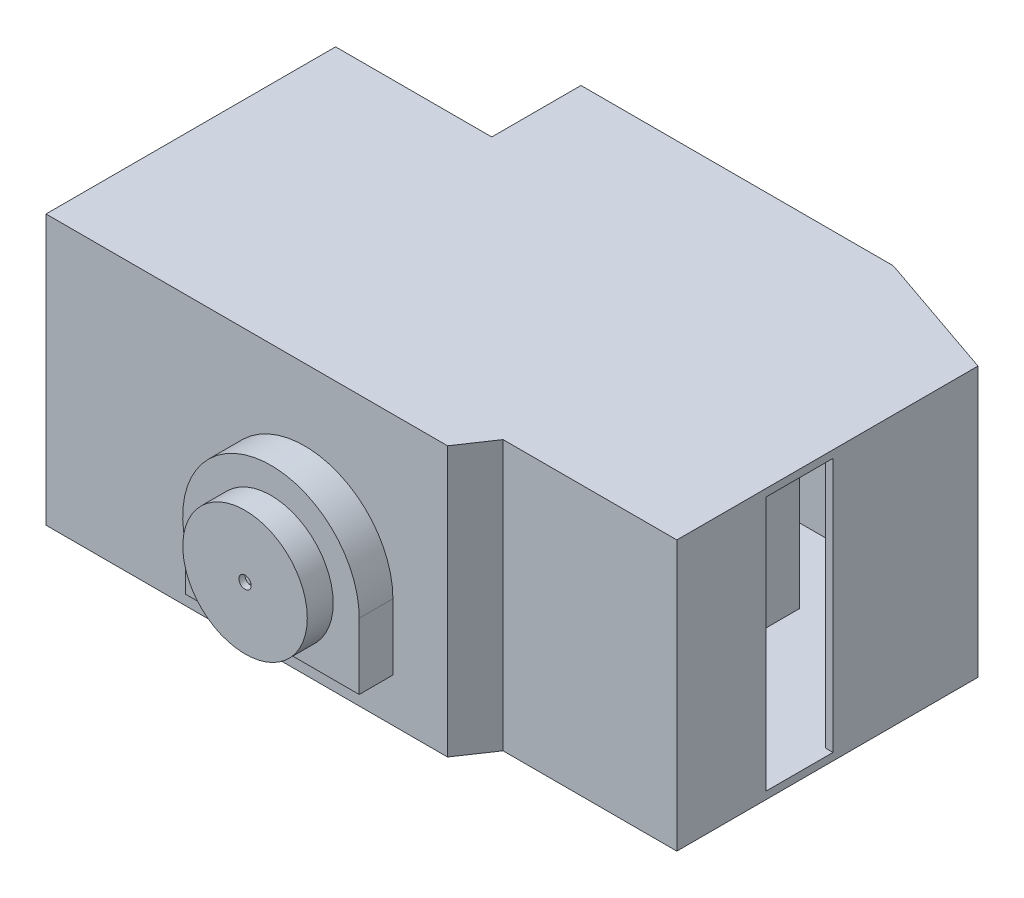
ISO-10303-21;
HEADER;
FILE_DESCRIPTION(('STEP AP214'),'2;1');
FILE_NAME('part.step','',(''),(''),'','','');
FILE_SCHEMA(('AUTOMOTIVE_DESIGN { 1 0 10303 214 1 1 1 1 }'));
ENDSEC;
DATA;
#1=APPLICATION_CONTEXT('core data for automotive mechanical design processes');
#2=APPLICATION_PROTOCOL_DEFINITION('international standard','automotive_design',2000,#1);
#3=PRODUCT_CONTEXT('',#1,'mechanical');
#4=PRODUCT('Part','Part','',(#3));
#5=PRODUCT_RELATED_PRODUCT_CATEGORY('part','',(#4));
#6=PRODUCT_DEFINITION_FORMATION('','',#4);
#7=PRODUCT_DEFINITION_CONTEXT('part definition',#1,'design');
#8=PRODUCT_DEFINITION('design','',#6,#7);
#9=PRODUCT_DEFINITION_SHAPE('','',#8);
#10=(LENGTH_UNIT() NAMED_UNIT(*) SI_UNIT(.MILLI.,.METRE.));
#11=(NAMED_UNIT(*) PLANE_ANGLE_UNIT() SI_UNIT($,.RADIAN.));
#12=(NAMED_UNIT(*) SI_UNIT($,.STERADIAN.) SOLID_ANGLE_UNIT());
#13=UNCERTAINTY_MEASURE_WITH_UNIT(LENGTH_MEASURE(1.E-05),#10,'distance_accuracy_value','');
#14=(GEOMETRIC_REPRESENTATION_CONTEXT(3) GLOBAL_UNCERTAINTY_ASSIGNED_CONTEXT((#13)) GLOBAL_UNIT_ASSIGNED_CONTEXT((#10,
#11,#12)) REPRESENTATION_CONTEXT('',''));
#15=CARTESIAN_POINT('',(0.,0.,0.));
#16=DIRECTION('',(0.,0.,1.));
#17=DIRECTION('',(1.,0.,0.));
#18=AXIS2_PLACEMENT_3D('',#15,#16,#17);
#19=CARTESIAN_POINT('',(0.686615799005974,3479.8,-3956.14060592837));
#20=DIRECTION('',(0.,-1.,0.));
#21=DIRECTION('',(0.,0.,-1.));
#22=AXIS2_PLACEMENT_3D('',#19,#20,#21);
#23=PLANE('',#22);
#24=DIRECTION('',(1.,0.,0.));
#25=VECTOR('',#24,1.);
#26=CARTESIAN_POINT('',(2235.88661579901,3479.8,-3854.54060592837));
#27=LINE('',#26,#25);
#28=CARTESIAN_POINT('',(102.286615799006,3479.8,-3854.54060592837));
#29=VERTEX_POINT('',#28);
#30=CARTESIAN_POINT('',(952.5,3479.8,-3854.54060592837));
#31=VERTEX_POINT('',#30);
#32=EDGE_CURVE('E521',#29,#31,#27,.T.);
#33=ORIENTED_EDGE('',*,*,#32,.T.);
#34=DIRECTION('',(0.,0.,-1.));
#35=VECTOR('',#34,1.);
#36=CARTESIAN_POINT('',(952.5,3479.8,-101.599999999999));
#37=LINE('',#36,#35);
#38=CARTESIAN_POINT('',(952.5,3479.8,-101.6));
#39=VERTEX_POINT('',#38);
#40=EDGE_CURVE('E51',#39,#31,#37,.T.);
#41=ORIENTED_EDGE('',*,*,#40,.F.);
#42=DIRECTION('',(-1.,0.,0.));
#43=VECTOR('',#42,1.);
#44=CARTESIAN_POINT('',(101.6,3479.8,-101.6));
#45=LINE('',#44,#43);
#46=CARTESIAN_POINT('',(101.6,3479.8,-101.6));
#47=VERTEX_POINT('',#46);
#48=EDGE_CURVE('E707',#39,#47,#45,.T.);
#49=ORIENTED_EDGE('',*,*,#48,.T.);
#50=DIRECTION('',(0.,0.,-1.));
#51=VECTOR('',#50,1.);
#52=CARTESIAN_POINT('',(101.6,3479.8,-101.6));
#53=LINE('',#52,#51);
#54=CARTESIAN_POINT('',(101.6,3479.8,-1524.));
#55=VERTEX_POINT('',#54);
#56=EDGE_CURVE('E710',#47,#55,#53,.T.);
#57=ORIENTED_EDGE('',*,*,#56,.T.);
#58=DIRECTION('',(-1.,0.,0.));
#59=VECTOR('',#58,1.);
#60=CARTESIAN_POINT('',(101.6,3479.8,-1524.));
#61=LINE('',#60,#59);
#62=CARTESIAN_POINT('',(0.264500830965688,3479.8,-1524.));
#63=VERTEX_POINT('',#62);
#64=EDGE_CURVE('E714',#55,#63,#61,.T.);
#65=ORIENTED_EDGE('',*,*,#64,.T.);
#66=DIRECTION('',(-0.000173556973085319,0.,0.999999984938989));
#67=VECTOR('',#66,1.);
#68=CARTESIAN_POINT('',(0.,3479.8,0.));
#69=LINE('',#68,#67);
#70=CARTESIAN_POINT('',(0.686615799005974,3479.8,-3956.14060592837));
#71=VERTEX_POINT('',#70);
#72=EDGE_CURVE('E44',#71,#63,#69,.T.);
#73=ORIENTED_EDGE('',*,*,#72,.F.);
#74=DIRECTION('',(0.,0.,1.));
#75=VECTOR('',#74,1.);
#76=CARTESIAN_POINT('',(0.686615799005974,3479.8,-3956.14060592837));
#77=LINE('',#76,#75);
#78=CARTESIAN_POINT('',(0.686615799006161,3479.8,-2432.14060592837));
#79=VERTEX_POINT('',#78);
#80=EDGE_CURVE('E511',#71,#79,#77,.T.);
#81=ORIENTED_EDGE('',*,*,#80,.T.);
#82=DIRECTION('',(1.,0.,0.));
#83=VECTOR('',#82,1.);
#84=CARTESIAN_POINT('',(0.686615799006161,3479.8,-2432.14060592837));
#85=LINE('',#84,#83);
#86=CARTESIAN_POINT('',(102.286615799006,3479.8,-2432.14060592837));
#87=VERTEX_POINT('',#86);
#88=EDGE_CURVE('E515',#79,#87,#85,.T.);
#89=ORIENTED_EDGE('',*,*,#88,.T.);
#90=DIRECTION('',(0.,0.,-1.));
#91=VECTOR('',#90,1.);
#92=CARTESIAN_POINT('',(102.286615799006,3479.8,-3854.54060592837));
#93=LINE('',#92,#91);
#94=EDGE_CURVE('E518',#87,#29,#93,.T.);
#95=ORIENTED_EDGE('',*,*,#94,.T.);
#96=EDGE_LOOP('',(#33,#41,#49,#57,#65,#73,#81,#89,#95));
#97=FACE_BOUND('',#96,.T.);
#98=ADVANCED_FACE('F33',(#97),#23,.T.);
#99=CARTESIAN_POINT('',(5432.37832174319,3479.8,-101.6));
#100=VERTEX_POINT('',#99);
#101=CARTESIAN_POINT('',(1066.8,3479.8,-101.6));
#102=VERTEX_POINT('',#101);
#103=EDGE_CURVE('E708',#100,#102,#45,.T.);
#104=ORIENTED_EDGE('',*,*,#103,.T.);
#105=DIRECTION('',(0.,0.,1.));
#106=VECTOR('',#105,1.);
#107=CARTESIAN_POINT('',(1066.8,3479.8,-101.599999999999));
#108=LINE('',#107,#106);
#109=CARTESIAN_POINT('',(1066.8,3479.8,-3854.54060592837));
#110=VERTEX_POINT('',#109);
#111=EDGE_CURVE('E390',#110,#102,#108,.T.);
#112=ORIENTED_EDGE('',*,*,#111,.F.);
#113=CARTESIAN_POINT('',(2235.88661579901,3479.8,-3854.54060592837));
#114=VERTEX_POINT('',#113);
#115=EDGE_CURVE('E379',#110,#114,#27,.T.);
#116=ORIENTED_EDGE('',*,*,#115,.T.);
#117=DIRECTION('',(0.,0.,-1.));
#118=VECTOR('',#117,1.);
#119=CARTESIAN_POINT('',(2235.88661579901,3479.8,-5073.74060592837));
#120=LINE('',#119,#118);
#121=CARTESIAN_POINT('',(2235.88661579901,3479.8,-5073.74060592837));
#122=VERTEX_POINT('',#121);
#123=EDGE_CURVE('E523',#114,#122,#120,.T.);
#124=ORIENTED_EDGE('',*,*,#123,.T.);
#125=DIRECTION('',(1.,0.,0.));
#126=VECTOR('',#125,1.);
#127=CARTESIAN_POINT('',(3201.08661579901,3479.8,-5073.74060592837));
#128=LINE('',#127,#126);
#129=CARTESIAN_POINT('',(3201.08661579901,3479.8,-5073.74060592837));
#130=VERTEX_POINT('',#129);
#131=EDGE_CURVE('E526',#122,#130,#128,.T.);
#132=ORIENTED_EDGE('',*,*,#131,.T.);
#133=DIRECTION('',(0.,0.,-1.));
#134=VECTOR('',#133,1.);
#135=CARTESIAN_POINT('',(3201.08661579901,3479.8,-5175.34060592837));
#136=LINE('',#135,#134);
#137=CARTESIAN_POINT('',(3201.08661579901,3479.8,-5175.34060592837));
#138=VERTEX_POINT('',#137);
#139=EDGE_CURVE('E508',#130,#138,#136,.T.);
#140=ORIENTED_EDGE('',*,*,#139,.T.);
#141=DIRECTION('',(-1.,0.,0.));
#142=VECTOR('',#141,1.);
#143=CARTESIAN_POINT('',(2134.28661579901,3479.8,-5175.34060592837));
#144=LINE('',#143,#142);
#145=CARTESIAN_POINT('',(5029.88661579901,3479.8,-5175.34060592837));
#146=VERTEX_POINT('',#145);
#147=EDGE_CURVE('E654',#146,#138,#144,.T.);
#148=ORIENTED_EDGE('',*,*,#147,.F.);
#149=DIRECTION('',(0.,0.,1.));
#150=VECTOR('',#149,1.);
#151=CARTESIAN_POINT('',(5029.88661579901,3479.8,-5175.34060592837));
#152=LINE('',#151,#150);
#153=CARTESIAN_POINT('',(5029.88661579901,3479.8,-5073.74060592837));
#154=VERTEX_POINT('',#153);
#155=EDGE_CURVE('E570',#146,#154,#152,.T.);
#156=ORIENTED_EDGE('',*,*,#155,.T.);
#157=DIRECTION('',(1.,0.,0.));
#158=VECTOR('',#157,1.);
#159=CARTESIAN_POINT('',(6134.67524458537,3479.8,-5073.74060592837));
#160=LINE('',#159,#158);
#161=CARTESIAN_POINT('',(6134.67524458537,3479.8,-5073.74060592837));
#162=VERTEX_POINT('',#161);
#163=EDGE_CURVE('E574',#154,#162,#160,.T.);
#164=ORIENTED_EDGE('',*,*,#163,.T.);
#165=DIRECTION('',(0.,0.,1.));
#166=VECTOR('',#165,1.);
#167=CARTESIAN_POINT('',(6134.67524458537,3479.8,-4973.93741837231));
#168=LINE('',#167,#166);
#169=CARTESIAN_POINT('',(6134.67524458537,3479.8,-4973.93741837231));
#170=VERTEX_POINT('',#169);
#171=EDGE_CURVE('E577',#162,#170,#168,.T.);
#172=ORIENTED_EDGE('',*,*,#171,.T.);
#173=DIRECTION('',(1.,0.,0.));
#174=VECTOR('',#173,1.);
#175=CARTESIAN_POINT('',(6134.67524458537,3479.8,-4973.93741837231));
#176=LINE('',#175,#174);
#177=CARTESIAN_POINT('',(6236.27524458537,3479.8,-4973.93741837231));
#178=VERTEX_POINT('',#177);
#179=EDGE_CURVE('E580',#170,#178,#176,.T.);
#180=ORIENTED_EDGE('',*,*,#179,.T.);
#181=DIRECTION('',(0.,0.,-1.));
#182=VECTOR('',#181,1.);
#183=CARTESIAN_POINT('',(6236.27524458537,3479.8,-4973.93741837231));
#184=LINE('',#183,#182);
#185=CARTESIAN_POINT('',(6236.27524458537,3479.8,-5073.74060592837));
#186=VERTEX_POINT('',#185);
#187=EDGE_CURVE('E583',#178,#186,#184,.T.);
#188=ORIENTED_EDGE('',*,*,#187,.T.);
#189=DIRECTION('',(1.,0.,0.));
#190=VECTOR('',#189,1.);
#191=CARTESIAN_POINT('',(6384.48460671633,3479.8,-5073.74060592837));
#192=LINE('',#191,#190);
#193=CARTESIAN_POINT('',(6384.48460671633,3479.8,-5073.74060592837));
#194=VERTEX_POINT('',#193);
#195=EDGE_CURVE('E586',#186,#194,#192,.T.);
#196=ORIENTED_EDGE('',*,*,#195,.T.);
#197=DIRECTION('',(0.945518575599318,0.,0.325568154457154));
#198=VECTOR('',#197,1.);
#199=CARTESIAN_POINT('',(8065.07524458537,3479.8,-4495.06684267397));
#200=LINE('',#199,#198);
#201=CARTESIAN_POINT('',(8065.07524458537,3479.8,-4495.06684267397));
#202=VERTEX_POINT('',#201);
#203=EDGE_CURVE('E589',#194,#202,#200,.T.);
#204=ORIENTED_EDGE('',*,*,#203,.T.);
#205=DIRECTION('',(0.,0.,1.));
#206=VECTOR('',#205,1.);
#207=CARTESIAN_POINT('',(8065.07524458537,3479.8,-2586.33741837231));
#208=LINE('',#207,#206);
#209=CARTESIAN_POINT('',(8065.07524458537,3479.8,-2586.33741837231));
#210=VERTEX_POINT('',#209);
#211=EDGE_CURVE('E592',#202,#210,#208,.T.);
#212=ORIENTED_EDGE('',*,*,#211,.T.);
#213=DIRECTION('',(1.,0.,0.));
#214=VECTOR('',#213,1.);
#215=CARTESIAN_POINT('',(8166.67524458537,3479.8,-2586.33741837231));
#216=LINE('',#215,#214);
#217=CARTESIAN_POINT('',(8166.67524458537,3479.8,-2586.33741837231));
#218=VERTEX_POINT('',#217);
#219=EDGE_CURVE('E567',#210,#218,#216,.T.);
#220=ORIENTED_EDGE('',*,*,#219,.T.);
#221=DIRECTION('',(0.,0.,-1.));
#222=VECTOR('',#221,1.);
#223=CARTESIAN_POINT('',(8166.67524458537,3479.8,-4567.53741837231));
#224=LINE('',#223,#222);
#225=CARTESIAN_POINT('',(8166.67524458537,3479.8,-1671.93741837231));
#226=VERTEX_POINT('',#225);
#227=EDGE_CURVE('E675',#226,#218,#224,.T.);
#228=ORIENTED_EDGE('',*,*,#227,.F.);
#229=DIRECTION('',(-1.,0.,0.));
#230=VECTOR('',#229,1.);
#231=CARTESIAN_POINT('',(8166.67524458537,3479.8,-1671.93741837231));
#232=LINE('',#231,#230);
#233=CARTESIAN_POINT('',(8065.07524458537,3479.8,-1671.93741837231));
#234=VERTEX_POINT('',#233);
#235=EDGE_CURVE('E689',#226,#234,#232,.T.);
#236=ORIENTED_EDGE('',*,*,#235,.T.);
#237=DIRECTION('',(0.,0.,1.));
#238=VECTOR('',#237,1.);
#239=CARTESIAN_POINT('',(8065.07524458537,3479.8,-554.337418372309));
#240=LINE('',#239,#238);
#241=CARTESIAN_POINT('',(8065.07524458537,3479.8,-554.337418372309));
#242=VERTEX_POINT('',#241);
#243=EDGE_CURVE('E685',#234,#242,#240,.T.);
#244=ORIENTED_EDGE('',*,*,#243,.T.);
#245=DIRECTION('',(-1.,0.,0.));
#246=VECTOR('',#245,1.);
#247=CARTESIAN_POINT('',(6236.27524458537,3479.8,-554.337418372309));
#248=LINE('',#247,#246);
#249=CARTESIAN_POINT('',(6236.27524458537,3479.8,-554.337418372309));
#250=VERTEX_POINT('',#249);
#251=EDGE_CURVE('E688',#242,#250,#248,.T.);
#252=ORIENTED_EDGE('',*,*,#251,.T.);
#253=DIRECTION('',(0.,0.,-1.));
#254=VECTOR('',#253,1.);
#255=CARTESIAN_POINT('',(6236.27524458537,3479.8,-554.337418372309));
#256=LINE('',#255,#254);
#257=CARTESIAN_POINT('',(6236.27524458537,3479.8,-4059.53741837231));
#258=VERTEX_POINT('',#257);
#259=EDGE_CURVE('E692',#250,#258,#256,.T.);
#260=ORIENTED_EDGE('',*,*,#259,.T.);
#261=DIRECTION('',(-1.,0.,0.));
#262=VECTOR('',#261,1.);
#263=CARTESIAN_POINT('',(6236.27524458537,3479.8,-4059.53741837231));
#264=LINE('',#263,#262);
#265=CARTESIAN_POINT('',(6134.67524458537,3479.8,-4059.53741837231));
#266=VERTEX_POINT('',#265);
#267=EDGE_CURVE('E695',#258,#266,#264,.T.);
#268=ORIENTED_EDGE('',*,*,#267,.T.);
#269=DIRECTION('',(0.,0.,1.));
#270=VECTOR('',#269,1.);
#271=CARTESIAN_POINT('',(6134.67524458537,3479.8,-554.337418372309));
#272=LINE('',#271,#270);
#273=CARTESIAN_POINT('',(6134.67524458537,3479.8,-554.337418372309));
#274=VERTEX_POINT('',#273);
#275=EDGE_CURVE('E698',#266,#274,#272,.T.);
#276=ORIENTED_EDGE('',*,*,#275,.T.);
#277=DIRECTION('',(-1.,0.,0.));
#278=VECTOR('',#277,1.);
#279=CARTESIAN_POINT('',(5737.75356632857,3479.8,-554.337418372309));
#280=LINE('',#279,#278);
#281=CARTESIAN_POINT('',(5737.75356632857,3479.8,-554.337418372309));
#282=VERTEX_POINT('',#281);
#283=EDGE_CURVE('E701',#274,#282,#280,.T.);
#284=ORIENTED_EDGE('',*,*,#283,.T.);
#285=DIRECTION('',(-0.559192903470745,0.,0.829037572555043));
#286=VECTOR('',#285,1.);
#287=CARTESIAN_POINT('',(5432.37832174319,3479.8,-101.6));
#288=LINE('',#287,#286);
#289=EDGE_CURVE('E704',#282,#100,#288,.T.);
#290=ORIENTED_EDGE('',*,*,#289,.T.);
#291=EDGE_LOOP('',(#104,#112,#116,#124,#132,#140,#148,#156,#164,#172,#180,#188,#196,#204,#212,
#220,#228,#236,#244,#252,#260,#268,#276,#284,#290));
#292=FACE_BOUND('',#291,.T.);
#293=ADVANCED_FACE('F795',(#292),#23,.T.);
#294=CARTESIAN_POINT('',(101.6,3479.8,-101.6));
#295=DIRECTION('',(0.,0.,1.));
#296=DIRECTION('',(1.,0.,0.));
#297=AXIS2_PLACEMENT_3D('',#294,#295,#296);
#298=PLANE('',#297);
#299=DIRECTION('',(0.,-1.,0.));
#300=VECTOR('',#299,1.);
#301=CARTESIAN_POINT('',(952.5,7234.48076960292,-101.599999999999));
#302=LINE('',#301,#300);
#303=CARTESIAN_POINT('',(952.5,0.,-101.599999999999));
#304=VERTEX_POINT('',#303);
#305=EDGE_CURVE('E394',#39,#304,#302,.T.);
#306=ORIENTED_EDGE('',*,*,#305,.T.);
#307=DIRECTION('',(-1.,0.,0.));
#308=VECTOR('',#307,1.);
#309=CARTESIAN_POINT('',(101.6,0.,-101.6));
#310=LINE('',#309,#308);
#311=CARTESIAN_POINT('',(101.6,0.,-101.6));
#312=VERTEX_POINT('',#311);
#313=EDGE_CURVE('E737',#304,#312,#310,.T.);
#314=ORIENTED_EDGE('',*,*,#313,.T.);
#315=DIRECTION('',(0.,-1.,0.));
#316=VECTOR('',#315,1.);
#317=CARTESIAN_POINT('',(101.6,3479.8,-101.6));
#318=LINE('',#317,#316);
#319=EDGE_CURVE('E756',#47,#312,#318,.T.);
#320=ORIENTED_EDGE('',*,*,#319,.F.);
#321=ORIENTED_EDGE('',*,*,#48,.F.);
#322=EDGE_LOOP('',(#306,#314,#320,#321));
#323=FACE_BOUND('',#322,.T.);
#324=ADVANCED_FACE('F832',(#323),#298,.F.);
#325=DIRECTION('',(-1.,0.,0.));
#326=VECTOR('',#325,1.);
#327=CARTESIAN_POINT('',(4286.8089083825,590.55,-101.6));
#328=LINE('',#327,#326);
#329=CARTESIAN_POINT('',(4286.8089083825,590.55,-101.6));
#330=VERTEX_POINT('',#329);
#331=CARTESIAN_POINT('',(2780.74109161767,590.55,-101.6));
#332=VERTEX_POINT('',#331);
#333=EDGE_CURVE('E416',#330,#332,#328,.T.);
#334=ORIENTED_EDGE('',*,*,#333,.F.);
#335=CARTESIAN_POINT('',(3533.77500000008,1398.399999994,-101.6));
#336=DIRECTION('',(0.,0.,-1.));
#337=DIRECTION('',(-1.,0.,0.));
#338=AXIS2_PLACEMENT_3D('',#335,#336,#337);
#339=CIRCLE('',#338,1104.392);
#340=EDGE_CURVE('E409',#332,#330,#339,.T.);
#341=ORIENTED_EDGE('',*,*,#340,.F.);
#342=EDGE_LOOP('',(#334,#341));
#343=FACE_BOUND('',#342,.T.);
#344=DIRECTION('',(0.,-1.,0.));
#345=VECTOR('',#344,1.);
#346=CARTESIAN_POINT('',(1066.8,7234.48076960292,-101.599999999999));
#347=LINE('',#346,#345);
#348=CARTESIAN_POINT('',(1066.8,0.,-101.6));
#349=VERTEX_POINT('',#348);
#350=EDGE_CURVE('E59',#102,#349,#347,.T.);
#351=ORIENTED_EDGE('',*,*,#350,.F.);
#352=ORIENTED_EDGE('',*,*,#103,.F.);
#353=DIRECTION('',(0.,-1.,0.));
#354=VECTOR('',#353,1.);
#355=CARTESIAN_POINT('',(5432.37832174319,3479.8,-101.6));
#356=LINE('',#355,#354);
#357=CARTESIAN_POINT('',(5432.37832174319,0.,-101.6));
#358=VERTEX_POINT('',#357);
#359=EDGE_CURVE('E759',#100,#358,#356,.T.);
#360=ORIENTED_EDGE('',*,*,#359,.T.);
#361=EDGE_CURVE('E738',#358,#349,#310,.T.);
#362=ORIENTED_EDGE('',*,*,#361,.T.);
#363=EDGE_LOOP('',(#351,#352,#360,#362));
#364=FACE_BOUND('',#363,.T.);
#365=ADVANCED_FACE('F827',(#343,#364),#298,.F.);
#366=CARTESIAN_POINT('',(2235.88661579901,3479.8,-3854.54060592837));
#367=DIRECTION('',(0.,0.,-1.));
#368=DIRECTION('',(-1.,0.,0.));
#369=AXIS2_PLACEMENT_3D('',#366,#367,#368);
#370=PLANE('',#369);
#371=DIRECTION('',(0.,-1.,0.));
#372=VECTOR('',#371,1.);
#373=CARTESIAN_POINT('',(952.5,7234.48076960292,-3854.54060592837));
#374=LINE('',#373,#372);
#375=CARTESIAN_POINT('',(952.5,0.,-3854.54060592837));
#376=VERTEX_POINT('',#375);
#377=EDGE_CURVE('E382',#31,#376,#374,.T.);
#378=ORIENTED_EDGE('',*,*,#377,.F.);
#379=ORIENTED_EDGE('',*,*,#32,.F.);
#380=DIRECTION('',(0.,-1.,0.));
#381=VECTOR('',#380,1.);
#382=CARTESIAN_POINT('',(102.286615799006,3479.8,-3854.54060592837));
#383=LINE('',#382,#381);
#384=CARTESIAN_POINT('',(102.286615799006,0.,-3854.54060592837));
#385=VERTEX_POINT('',#384);
#386=EDGE_CURVE('E551',#29,#385,#383,.T.);
#387=ORIENTED_EDGE('',*,*,#386,.T.);
#388=DIRECTION('',(1.,0.,0.));
#389=VECTOR('',#388,1.);
#390=CARTESIAN_POINT('',(2235.88661579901,0.,-3854.54060592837));
#391=LINE('',#390,#389);
#392=EDGE_CURVE('E372',#385,#376,#391,.T.);
#393=ORIENTED_EDGE('',*,*,#392,.T.);
#394=EDGE_LOOP('',(#378,#379,#387,#393));
#395=FACE_BOUND('',#394,.T.);
#396=ADVANCED_FACE('F892',(#395),#370,.F.);
#397=DIRECTION('',(0.,-1.,0.));
#398=VECTOR('',#397,1.);
#399=CARTESIAN_POINT('',(1066.8,7234.48076960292,-3854.54060592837));
#400=LINE('',#399,#398);
#401=CARTESIAN_POINT('',(1066.8,0.,-3854.54060592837));
#402=VERTEX_POINT('',#401);
#403=EDGE_CURVE('E377',#110,#402,#400,.T.);
#404=ORIENTED_EDGE('',*,*,#403,.T.);
#405=CARTESIAN_POINT('',(2235.88661579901,0.,-3854.54060592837));
#406=VERTEX_POINT('',#405);
#407=EDGE_CURVE('E361',#402,#406,#391,.T.);
#408=ORIENTED_EDGE('',*,*,#407,.T.);
#409=DIRECTION('',(0.,-1.,0.));
#410=VECTOR('',#409,1.);
#411=CARTESIAN_POINT('',(2235.88661579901,3479.8,-3854.54060592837));
#412=LINE('',#411,#410);
#413=EDGE_CURVE('E549',#114,#406,#412,.T.);
#414=ORIENTED_EDGE('',*,*,#413,.F.);
#415=ORIENTED_EDGE('',*,*,#115,.F.);
#416=EDGE_LOOP('',(#404,#408,#414,#415));
#417=FACE_BOUND('',#416,.T.);
#418=ADVANCED_FACE('F378',(#417),#370,.F.);
#419=CARTESIAN_POINT('',(8166.67524458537,0.,-452.737418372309));
#420=DIRECTION('',(0.,-1.,0.));
#421=DIRECTION('',(0.,0.,-1.));
#422=AXIS2_PLACEMENT_3D('',#419,#420,#421);
#423=PLANE('',#422);
#424=DIRECTION('',(0.,0.,1.));
#425=VECTOR('',#424,1.);
#426=CARTESIAN_POINT('',(952.5,0.,-101.599999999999));
#427=LINE('',#426,#425);
#428=EDGE_CURVE('E385',#376,#304,#427,.T.);
#429=ORIENTED_EDGE('',*,*,#428,.F.);
#430=ORIENTED_EDGE('',*,*,#392,.F.);
#431=DIRECTION('',(0.,0.,-1.));
#432=VECTOR('',#431,1.);
#433=CARTESIAN_POINT('',(102.286615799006,0.,-3854.54060592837));
#434=LINE('',#433,#432);
#435=CARTESIAN_POINT('',(102.286615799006,0.,-2432.14060592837));
#436=VERTEX_POINT('',#435);
#437=EDGE_CURVE('E373',#436,#385,#434,.T.);
#438=ORIENTED_EDGE('',*,*,#437,.F.);
#439=DIRECTION('',(1.,0.,0.));
#440=VECTOR('',#439,1.);
#441=CARTESIAN_POINT('',(0.686615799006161,0.,-2432.14060592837));
#442=LINE('',#441,#440);
#443=CARTESIAN_POINT('',(0.686615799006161,0.,-2432.14060592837));
#444=VERTEX_POINT('',#443);
#445=EDGE_CURVE('E535',#444,#436,#442,.T.);
#446=ORIENTED_EDGE('',*,*,#445,.F.);
#447=DIRECTION('',(0.,0.,1.));
#448=VECTOR('',#447,1.);
#449=CARTESIAN_POINT('',(0.686615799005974,0.,-3956.14060592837));
#450=LINE('',#449,#448);
#451=CARTESIAN_POINT('',(0.686615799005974,0.,-3956.14060592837));
#452=VERTEX_POINT('',#451);
#453=EDGE_CURVE('E532',#452,#444,#450,.T.);
#454=ORIENTED_EDGE('',*,*,#453,.F.);
#455=DIRECTION('',(0.000173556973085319,0.,-0.999999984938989));
#456=VECTOR('',#455,1.);
#457=CARTESIAN_POINT('',(0.,0.,0.));
#458=LINE('',#457,#456);
#459=CARTESIAN_POINT('',(0.264500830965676,0.,-1524.));
#460=VERTEX_POINT('',#459);
#461=EDGE_CURVE('E496',#460,#452,#458,.T.);
#462=ORIENTED_EDGE('',*,*,#461,.F.);
#463=DIRECTION('',(-1.,0.,0.));
#464=VECTOR('',#463,1.);
#465=CARTESIAN_POINT('',(101.6,0.,-1524.));
#466=LINE('',#465,#464);
#467=CARTESIAN_POINT('',(101.6,0.,-1524.));
#468=VERTEX_POINT('',#467);
#469=EDGE_CURVE('E743',#468,#460,#466,.T.);
#470=ORIENTED_EDGE('',*,*,#469,.F.);
#471=DIRECTION('',(0.,0.,-1.));
#472=VECTOR('',#471,1.);
#473=CARTESIAN_POINT('',(101.6,0.,-101.6));
#474=LINE('',#473,#472);
#475=EDGE_CURVE('E740',#312,#468,#474,.T.);
#476=ORIENTED_EDGE('',*,*,#475,.F.);
#477=ORIENTED_EDGE('',*,*,#313,.F.);
#478=EDGE_LOOP('',(#429,#430,#438,#446,#454,#462,#470,#476,#477));
#479=FACE_BOUND('',#478,.T.);
#480=ADVANCED_FACE('F884',(#479),#423,.F.);
#481=DIRECTION('',(0.,0.,-1.));
#482=VECTOR('',#481,1.);
#483=CARTESIAN_POINT('',(1066.8,0.,-101.599999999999));
#484=LINE('',#483,#482);
#485=EDGE_CURVE('E366',#349,#402,#484,.T.);
#486=ORIENTED_EDGE('',*,*,#485,.F.);
#487=ORIENTED_EDGE('',*,*,#361,.F.);
#488=DIRECTION('',(-0.559192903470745,0.,0.829037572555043));
#489=VECTOR('',#488,1.);
#490=CARTESIAN_POINT('',(5432.37832174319,0.,-101.6));
#491=LINE('',#490,#489);
#492=CARTESIAN_POINT('',(5737.75356632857,0.,-554.337418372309));
#493=VERTEX_POINT('',#492);
#494=EDGE_CURVE('E735',#493,#358,#491,.T.);
#495=ORIENTED_EDGE('',*,*,#494,.F.);
#496=DIRECTION('',(-1.,0.,0.));
#497=VECTOR('',#496,1.);
#498=CARTESIAN_POINT('',(5737.75356632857,0.,-554.337418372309));
#499=LINE('',#498,#497);
#500=CARTESIAN_POINT('',(6134.67524458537,0.,-554.337418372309));
#501=VERTEX_POINT('',#500);
#502=EDGE_CURVE('E733',#501,#493,#499,.T.);
#503=ORIENTED_EDGE('',*,*,#502,.F.);
#504=DIRECTION('',(0.,0.,1.));
#505=VECTOR('',#504,1.);
#506=CARTESIAN_POINT('',(6134.67524458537,0.,-554.337418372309));
#507=LINE('',#506,#505);
#508=CARTESIAN_POINT('',(6134.67524458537,0.,-4059.53741837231));
#509=VERTEX_POINT('',#508);
#510=EDGE_CURVE('E731',#509,#501,#507,.T.);
#511=ORIENTED_EDGE('',*,*,#510,.F.);
#512=DIRECTION('',(-1.,0.,0.));
#513=VECTOR('',#512,1.);
#514=CARTESIAN_POINT('',(6236.27524458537,0.,-4059.53741837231));
#515=LINE('',#514,#513);
#516=CARTESIAN_POINT('',(6236.27524458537,0.,-4059.53741837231));
#517=VERTEX_POINT('',#516);
#518=EDGE_CURVE('E729',#517,#509,#515,.T.);
#519=ORIENTED_EDGE('',*,*,#518,.F.);
#520=DIRECTION('',(0.,0.,-1.));
#521=VECTOR('',#520,1.);
#522=CARTESIAN_POINT('',(6236.27524458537,0.,-554.337418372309));
#523=LINE('',#522,#521);
#524=CARTESIAN_POINT('',(6236.27524458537,0.,-554.337418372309));
#525=VERTEX_POINT('',#524);
#526=EDGE_CURVE('E727',#525,#517,#523,.T.);
#527=ORIENTED_EDGE('',*,*,#526,.F.);
#528=DIRECTION('',(-1.,0.,0.));
#529=VECTOR('',#528,1.);
#530=CARTESIAN_POINT('',(6236.27524458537,0.,-554.337418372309));
#531=LINE('',#530,#529);
#532=CARTESIAN_POINT('',(8065.07524458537,0.,-554.337418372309));
#533=VERTEX_POINT('',#532);
#534=EDGE_CURVE('E725',#533,#525,#531,.T.);
#535=ORIENTED_EDGE('',*,*,#534,.F.);
#536=DIRECTION('',(0.,0.,1.));
#537=VECTOR('',#536,1.);
#538=CARTESIAN_POINT('',(8065.07524458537,0.,-554.337418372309));
#539=LINE('',#538,#537);
#540=CARTESIAN_POINT('',(8065.07524458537,0.,-1671.93741837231));
#541=VERTEX_POINT('',#540);
#542=EDGE_CURVE('E723',#541,#533,#539,.T.);
#543=ORIENTED_EDGE('',*,*,#542,.F.);
#544=DIRECTION('',(-1.,0.,0.));
#545=VECTOR('',#544,1.);
#546=CARTESIAN_POINT('',(8166.67524458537,0.,-1671.93741837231));
#547=LINE('',#546,#545);
#548=CARTESIAN_POINT('',(8166.67524458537,0.,-1671.93741837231));
#549=VERTEX_POINT('',#548);
#550=EDGE_CURVE('E721',#549,#541,#547,.T.);
#551=ORIENTED_EDGE('',*,*,#550,.F.);
#552=DIRECTION('',(0.,0.,1.));
#553=VECTOR('',#552,1.);
#554=CARTESIAN_POINT('',(8166.67524458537,0.,-4567.53741837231));
#555=LINE('',#554,#553);
#556=CARTESIAN_POINT('',(8166.67524458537,0.,-2586.33741837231));
#557=VERTEX_POINT('',#556);
#558=EDGE_CURVE('E466',#557,#549,#555,.T.);
#559=ORIENTED_EDGE('',*,*,#558,.F.);
#560=DIRECTION('',(1.,0.,0.));
#561=VECTOR('',#560,1.);
#562=CARTESIAN_POINT('',(8166.67524458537,0.,-2586.33741837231));
#563=LINE('',#562,#561);
#564=CARTESIAN_POINT('',(8065.07524458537,0.,-2586.33741837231));
#565=VERTEX_POINT('',#564);
#566=EDGE_CURVE('E566',#565,#557,#563,.T.);
#567=ORIENTED_EDGE('',*,*,#566,.F.);
#568=DIRECTION('',(0.,0.,1.));
#569=VECTOR('',#568,1.);
#570=CARTESIAN_POINT('',(8065.07524458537,0.,-2586.33741837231));
#571=LINE('',#570,#569);
#572=CARTESIAN_POINT('',(8065.07524458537,0.,-4495.06684267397));
#573=VERTEX_POINT('',#572);
#574=EDGE_CURVE('E571',#573,#565,#571,.T.);
#575=ORIENTED_EDGE('',*,*,#574,.F.);
#576=DIRECTION('',(0.945518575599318,0.,0.325568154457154));
#577=VECTOR('',#576,1.);
#578=CARTESIAN_POINT('',(8065.07524458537,0.,-4495.06684267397));
#579=LINE('',#578,#577);
#580=CARTESIAN_POINT('',(6384.48460671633,0.,-5073.74060592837));
#581=VERTEX_POINT('',#580);
#582=EDGE_CURVE('E616',#581,#573,#579,.T.);
#583=ORIENTED_EDGE('',*,*,#582,.F.);
#584=DIRECTION('',(1.,0.,0.));
#585=VECTOR('',#584,1.);
#586=CARTESIAN_POINT('',(6384.48460671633,0.,-5073.74060592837));
#587=LINE('',#586,#585);
#588=CARTESIAN_POINT('',(6236.27524458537,0.,-5073.74060592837));
#589=VERTEX_POINT('',#588);
#590=EDGE_CURVE('E613',#589,#581,#587,.T.);
#591=ORIENTED_EDGE('',*,*,#590,.F.);
#592=DIRECTION('',(0.,0.,-1.));
#593=VECTOR('',#592,1.);
#594=CARTESIAN_POINT('',(6236.27524458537,0.,-4973.93741837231));
#595=LINE('',#594,#593);
#596=CARTESIAN_POINT('',(6236.27524458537,0.,-4973.93741837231));
#597=VERTEX_POINT('',#596);
#598=EDGE_CURVE('E610',#597,#589,#595,.T.);
#599=ORIENTED_EDGE('',*,*,#598,.F.);
#600=DIRECTION('',(1.,0.,0.));
#601=VECTOR('',#600,1.);
#602=CARTESIAN_POINT('',(6134.67524458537,0.,-4973.93741837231));
#603=LINE('',#602,#601);
#604=CARTESIAN_POINT('',(6134.67524458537,0.,-4973.93741837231));
#605=VERTEX_POINT('',#604);
#606=EDGE_CURVE('E607',#605,#597,#603,.T.);
#607=ORIENTED_EDGE('',*,*,#606,.F.);
#608=DIRECTION('',(0.,0.,1.));
#609=VECTOR('',#608,1.);
#610=CARTESIAN_POINT('',(6134.67524458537,0.,-4973.93741837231));
#611=LINE('',#610,#609);
#612=CARTESIAN_POINT('',(6134.67524458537,0.,-5073.74060592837));
#613=VERTEX_POINT('',#612);
#614=EDGE_CURVE('E604',#613,#605,#611,.T.);
#615=ORIENTED_EDGE('',*,*,#614,.F.);
#616=DIRECTION('',(1.,0.,0.));
#617=VECTOR('',#616,1.);
#618=CARTESIAN_POINT('',(6134.67524458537,0.,-5073.74060592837));
#619=LINE('',#618,#617);
#620=CARTESIAN_POINT('',(5029.88661579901,0.,-5073.74060592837));
#621=VERTEX_POINT('',#620);
#622=EDGE_CURVE('E601',#621,#613,#619,.T.);
#623=ORIENTED_EDGE('',*,*,#622,.F.);
#624=DIRECTION('',(0.,0.,1.));
#625=VECTOR('',#624,1.);
#626=CARTESIAN_POINT('',(5029.88661579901,0.,-5175.34060592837));
#627=LINE('',#626,#625);
#628=CARTESIAN_POINT('',(5029.88661579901,0.,-5175.34060592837));
#629=VERTEX_POINT('',#628);
#630=EDGE_CURVE('E598',#629,#621,#627,.T.);
#631=ORIENTED_EDGE('',*,*,#630,.F.);
#632=DIRECTION('',(1.,0.,0.));
#633=VECTOR('',#632,1.);
#634=CARTESIAN_POINT('',(2134.28661579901,0.,-5175.34060592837));
#635=LINE('',#634,#633);
#636=CARTESIAN_POINT('',(3201.08661579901,0.,-5175.34060592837));
#637=VERTEX_POINT('',#636);
#638=EDGE_CURVE('E471',#637,#629,#635,.T.);
#639=ORIENTED_EDGE('',*,*,#638,.F.);
#640=DIRECTION('',(0.,0.,-1.));
#641=VECTOR('',#640,1.);
#642=CARTESIAN_POINT('',(3201.08661579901,0.,-5175.34060592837));
#643=LINE('',#642,#641);
#644=CARTESIAN_POINT('',(3201.08661579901,0.,-5073.74060592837));
#645=VERTEX_POINT('',#644);
#646=EDGE_CURVE('E507',#645,#637,#643,.T.);
#647=ORIENTED_EDGE('',*,*,#646,.F.);
#648=DIRECTION('',(1.,0.,0.));
#649=VECTOR('',#648,1.);
#650=CARTESIAN_POINT('',(3201.08661579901,0.,-5073.74060592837));
#651=LINE('',#650,#649);
#652=CARTESIAN_POINT('',(2235.88661579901,0.,-5073.74060592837));
#653=VERTEX_POINT('',#652);
#654=EDGE_CURVE('E512',#653,#645,#651,.T.);
#655=ORIENTED_EDGE('',*,*,#654,.F.);
#656=DIRECTION('',(0.,0.,-1.));
#657=VECTOR('',#656,1.);
#658=CARTESIAN_POINT('',(2235.88661579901,0.,-5073.74060592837));
#659=LINE('',#658,#657);
#660=EDGE_CURVE('E368',#406,#653,#659,.T.);
#661=ORIENTED_EDGE('',*,*,#660,.F.);
#662=ORIENTED_EDGE('',*,*,#407,.F.);
#663=EDGE_LOOP('',(#486,#487,#495,#503,#511,#519,#527,#535,#543,#551,#559,#567,#575,#583,#591,
#599,#607,#615,#623,#631,#639,#647,#655,#661,#662));
#664=FACE_BOUND('',#663,.T.);
#665=ADVANCED_FACE('F363',(#664),#423,.F.);
#666=CARTESIAN_POINT('',(3533.77500000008,1398.399999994,460.0575));
#667=DIRECTION('',(0.,0.,1.));
#668=DIRECTION('',(1.,0.,0.));
#669=AXIS2_PLACEMENT_3D('',#666,#667,#668);
#670=PLANE('',#669);
#671=DIRECTION('',(0.,-1.,0.));
#672=VECTOR('',#671,1.);
#673=CARTESIAN_POINT('',(2368.55,1087.45515058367,460.0575));
#674=LINE('',#673,#672);
#675=CARTESIAN_POINT('',(2368.55,1087.45515058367,460.0575));
#676=VERTEX_POINT('',#675);
#677=CARTESIAN_POINT('',(2368.55,495.3,460.0575));
#678=VERTEX_POINT('',#677);
#679=EDGE_CURVE('E434',#676,#678,#674,.T.);
#680=ORIENTED_EDGE('',*,*,#679,.T.);
#681=DIRECTION('',(1.,0.,0.));
#682=VECTOR('',#681,1.);
#683=CARTESIAN_POINT('',(2368.55,495.3,460.0575));
#684=LINE('',#683,#682);
#685=CARTESIAN_POINT('',(4739.77500000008,495.3,460.0575));
#686=VERTEX_POINT('',#685);
#687=EDGE_CURVE('E437',#678,#686,#684,.T.);
#688=ORIENTED_EDGE('',*,*,#687,.T.);
#689=DIRECTION('',(0.,1.,0.));
#690=VECTOR('',#689,1.);
#691=CARTESIAN_POINT('',(4739.77500000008,1398.399999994,460.0575));
#692=LINE('',#691,#690);
#693=CARTESIAN_POINT('',(4739.77500000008,1398.399999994,460.0575));
#694=VERTEX_POINT('',#693);
#695=EDGE_CURVE('E440',#686,#694,#692,.T.);
#696=ORIENTED_EDGE('',*,*,#695,.T.);
#697=CARTESIAN_POINT('',(3533.77500000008,1398.399999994,460.0575));
#698=DIRECTION('',(0.,0.,1.));
#699=DIRECTION('',(1.,0.,0.));
#700=AXIS2_PLACEMENT_3D('',#697,#698,#699);
#701=CIRCLE('',#700,1206.);
#702=EDGE_CURVE('E442',#694,#676,#701,.T.);
#703=ORIENTED_EDGE('',*,*,#702,.T.);
#704=EDGE_LOOP('',(#680,#688,#696,#703));
#705=FACE_BOUND('',#704,.T.);
#706=CARTESIAN_POINT('',(3533.77500000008,1398.399999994,460.0575));
#707=DIRECTION('',(0.,0.,1.));
#708=DIRECTION('',(1.,0.,0.));
#709=AXIS2_PLACEMENT_3D('',#706,#707,#708);
#710=CIRCLE('',#709,850.392000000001);
#711=CARTESIAN_POINT('',(4384.16700000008,1398.399999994,460.0575));
#712=VERTEX_POINT('',#711);
#713=EDGE_CURVE('E425',#712,#712,#710,.T.);
#714=ORIENTED_EDGE('',*,*,#713,.F.);
#715=EDGE_LOOP('',(#714));
#716=FACE_BOUND('',#715,.T.);
#717=ADVANCED_FACE('F1073',(#705,#716),#670,.T.);
#718=CARTESIAN_POINT('',(0.,3479.8,0.));
#719=DIRECTION('',(0.,0.,-1.));
#720=DIRECTION('',(-1.,0.,0.));
#721=AXIS2_PLACEMENT_3D('',#718,#719,#720);
#722=PLANE('',#721);
#723=DIRECTION('',(0.,-1.,0.));
#724=VECTOR('',#723,1.);
#725=CARTESIAN_POINT('',(0.,3479.8,0.));
#726=LINE('',#725,#724);
#727=CARTESIAN_POINT('',(0.,3479.8,0.));
#728=VERTEX_POINT('',#727);
#729=CARTESIAN_POINT('',(0.,0.,0.));
#730=VERTEX_POINT('',#729);
#731=EDGE_CURVE('E720',#728,#730,#726,.T.);
#732=ORIENTED_EDGE('',*,*,#731,.T.);
#733=DIRECTION('',(0.,1.,0.));
#734=VECTOR('',#733,1.);
#735=CARTESIAN_POINT('',(0.,-101.6,0.));
#736=LINE('',#735,#734);
#737=CARTESIAN_POINT('',(0.,-101.6,0.));
#738=VERTEX_POINT('',#737);
#739=EDGE_CURVE('E504',#738,#730,#736,.T.);
#740=ORIENTED_EDGE('',*,*,#739,.F.);
#741=DIRECTION('',(-1.,0.,0.));
#742=VECTOR('',#741,1.);
#743=CARTESIAN_POINT('',(5486.4,-101.6,0.));
#744=LINE('',#743,#742);
#745=CARTESIAN_POINT('',(5486.4,-101.6,0.));
#746=VERTEX_POINT('',#745);
#747=EDGE_CURVE('E477',#746,#738,#744,.T.);
#748=ORIENTED_EDGE('',*,*,#747,.F.);
#749=DIRECTION('',(0.,-1.,0.));
#750=VECTOR('',#749,1.);
#751=CARTESIAN_POINT('',(5486.4,3479.8,0.));
#752=LINE('',#751,#750);
#753=CARTESIAN_POINT('',(5486.4,3581.4,0.));
#754=VERTEX_POINT('',#753);
#755=EDGE_CURVE('E42',#754,#746,#752,.T.);
#756=ORIENTED_EDGE('',*,*,#755,.F.);
#757=DIRECTION('',(1.,0.,0.));
#758=VECTOR('',#757,1.);
#759=CARTESIAN_POINT('',(5486.4,3581.4,0.));
#760=LINE('',#759,#758);
#761=CARTESIAN_POINT('',(0.,3581.4,0.));
#762=VERTEX_POINT('',#761);
#763=EDGE_CURVE('E653',#762,#754,#760,.T.);
#764=ORIENTED_EDGE('',*,*,#763,.F.);
#765=DIRECTION('',(0.,-1.,0.));
#766=VECTOR('',#765,1.);
#767=CARTESIAN_POINT('',(0.,3581.4,0.));
#768=LINE('',#767,#766);
#769=EDGE_CURVE('E683',#762,#728,#768,.T.);
#770=ORIENTED_EDGE('',*,*,#769,.T.);
#771=EDGE_LOOP('',(#732,#740,#748,#756,#764,#770));
#772=FACE_BOUND('',#771,.T.);
#773=DIRECTION('',(0.,-1.,0.));
#774=VECTOR('',#773,1.);
#775=CARTESIAN_POINT('',(2368.55,1087.45515058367,0.));
#776=LINE('',#775,#774);
#777=CARTESIAN_POINT('',(2368.55,1087.45515058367,0.));
#778=VERTEX_POINT('',#777);
#779=CARTESIAN_POINT('',(2368.55,495.3,0.));
#780=VERTEX_POINT('',#779);
#781=EDGE_CURVE('E431',#778,#780,#776,.T.);
#782=ORIENTED_EDGE('',*,*,#781,.F.);
#783=CARTESIAN_POINT('',(3533.77500000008,1398.399999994,0.));
#784=DIRECTION('',(0.,0.,1.));
#785=DIRECTION('',(1.,0.,0.));
#786=AXIS2_PLACEMENT_3D('',#783,#784,#785);
#787=CIRCLE('',#786,1206.);
#788=CARTESIAN_POINT('',(4739.77500000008,1398.399999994,0.));
#789=VERTEX_POINT('',#788);
#790=EDGE_CURVE('E438',#789,#778,#787,.T.);
#791=ORIENTED_EDGE('',*,*,#790,.F.);
#792=DIRECTION('',(0.,1.,0.));
#793=VECTOR('',#792,1.);
#794=CARTESIAN_POINT('',(4739.77500000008,1398.399999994,0.));
#795=LINE('',#794,#793);
#796=CARTESIAN_POINT('',(4739.77500000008,495.3,0.));
#797=VERTEX_POINT('',#796);
#798=EDGE_CURVE('E450',#797,#789,#795,.T.);
#799=ORIENTED_EDGE('',*,*,#798,.F.);
#800=DIRECTION('',(1.,0.,0.));
#801=VECTOR('',#800,1.);
#802=CARTESIAN_POINT('',(2368.55,495.3,0.));
#803=LINE('',#802,#801);
#804=EDGE_CURVE('E447',#780,#797,#803,.T.);
#805=ORIENTED_EDGE('',*,*,#804,.F.);
#806=EDGE_LOOP('',(#782,#791,#799,#805));
#807=FACE_BOUND('',#806,.T.);
#808=ADVANCED_FACE('F35',(#772,#807),#722,.F.);
#809=CARTESIAN_POINT('',(8166.67524458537,0.,-1.11022302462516E-13));
#810=DIRECTION('',(0.,1.,0.));
#811=DIRECTION('',(0.,0.,1.));
#812=AXIS2_PLACEMENT_3D('',#809,#810,#811);
#813=PLANE('',#812);
#814=EDGE_CURVE('E497',#730,#460,#458,.T.);
#815=ORIENTED_EDGE('',*,*,#814,.F.);
#816=DIRECTION('',(0.,0.,1.));
#817=VECTOR('',#816,1.);
#818=CARTESIAN_POINT('',(0.,0.,0.));
#819=LINE('',#818,#817);
#820=CARTESIAN_POINT('',(0.,0.,-1524.));
#821=VERTEX_POINT('',#820);
#822=EDGE_CURVE('E745',#821,#730,#819,.T.);
#823=ORIENTED_EDGE('',*,*,#822,.F.);
#824=EDGE_CURVE('E742',#460,#821,#466,.T.);
#825=ORIENTED_EDGE('',*,*,#824,.F.);
#826=EDGE_LOOP('',(#815,#823,#825));
#827=FACE_BOUND('',#826,.T.);
#828=ADVANCED_FACE('F930',(#827),#813,.F.);
#829=CARTESIAN_POINT('',(5486.4,3479.8,0.));
#830=DIRECTION('',(-0.829037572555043,0.,-0.559192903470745));
#831=DIRECTION('',(-0.559192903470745,0.,0.829037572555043));
#832=AXIS2_PLACEMENT_3D('',#829,#830,#831);
#833=PLANE('',#832);
#834=ORIENTED_EDGE('',*,*,#755,.T.);
#835=DIRECTION('',(-0.559192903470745,0.,0.829037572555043));
#836=VECTOR('',#835,1.);
#837=CARTESIAN_POINT('',(5791.77524458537,-101.6,-452.737418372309));
#838=LINE('',#837,#836);
#839=CARTESIAN_POINT('',(5791.77524458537,-101.6,-452.737418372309));
#840=VERTEX_POINT('',#839);
#841=EDGE_CURVE('E474',#840,#746,#838,.T.);
#842=ORIENTED_EDGE('',*,*,#841,.F.);
#843=DIRECTION('',(0.,-1.,0.));
#844=VECTOR('',#843,1.);
#845=CARTESIAN_POINT('',(5791.77524458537,3479.8,-452.737418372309));
#846=LINE('',#845,#844);
#847=CARTESIAN_POINT('',(5791.77524458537,3581.4,-452.737418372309));
#848=VERTEX_POINT('',#847);
#849=EDGE_CURVE('E786',#848,#840,#846,.T.);
#850=ORIENTED_EDGE('',*,*,#849,.F.);
#851=DIRECTION('',(0.559192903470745,0.,-0.829037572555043));
#852=VECTOR('',#851,1.);
#853=CARTESIAN_POINT('',(5791.77524458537,3581.4,-452.737418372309));
#854=LINE('',#853,#852);
#855=EDGE_CURVE('E657',#754,#848,#854,.T.);
#856=ORIENTED_EDGE('',*,*,#855,.F.);
#857=EDGE_LOOP('',(#834,#842,#850,#856));
#858=FACE_BOUND('',#857,.T.);
#859=ADVANCED_FACE('F933',(#858),#833,.F.);
#860=CARTESIAN_POINT('',(5791.77524458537,3479.8,-452.737418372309));
#861=DIRECTION('',(0.,0.,-1.));
#862=DIRECTION('',(-1.,0.,0.));
#863=AXIS2_PLACEMENT_3D('',#860,#861,#862);
#864=PLANE('',#863);
#865=ORIENTED_EDGE('',*,*,#849,.T.);
#866=DIRECTION('',(-1.,0.,0.));
#867=VECTOR('',#866,1.);
#868=CARTESIAN_POINT('',(8166.67524458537,-101.6,-452.737418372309));
#869=LINE('',#868,#867);
#870=CARTESIAN_POINT('',(8166.67524458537,-101.6,-452.737418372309));
#871=VERTEX_POINT('',#870);
#872=EDGE_CURVE('E470',#871,#840,#869,.T.);
#873=ORIENTED_EDGE('',*,*,#872,.F.);
#874=DIRECTION('',(0.,-1.,0.));
#875=VECTOR('',#874,1.);
#876=CARTESIAN_POINT('',(8166.67524458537,3479.8,-452.737418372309));
#877=LINE('',#876,#875);
#878=CARTESIAN_POINT('',(8166.67524458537,3581.4,-452.737418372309));
#879=VERTEX_POINT('',#878);
#880=EDGE_CURVE('E784',#879,#871,#877,.T.);
#881=ORIENTED_EDGE('',*,*,#880,.F.);
#882=DIRECTION('',(1.,0.,0.));
#883=VECTOR('',#882,1.);
#884=CARTESIAN_POINT('',(8166.67524458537,3581.4,-452.737418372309));
#885=LINE('',#884,#883);
#886=EDGE_CURVE('E660',#848,#879,#885,.T.);
#887=ORIENTED_EDGE('',*,*,#886,.F.);
#888=EDGE_LOOP('',(#865,#873,#881,#887));
#889=FACE_BOUND('',#888,.T.);
#890=ADVANCED_FACE('F962',(#889),#864,.F.);
#891=CARTESIAN_POINT('',(8166.67524458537,3479.8,-452.737418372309));
#892=DIRECTION('',(-1.,0.,0.));
#893=DIRECTION('',(0.,0.,1.));
#894=AXIS2_PLACEMENT_3D('',#891,#892,#893);
#895=PLANE('',#894);
#896=ORIENTED_EDGE('',*,*,#558,.T.);
#897=DIRECTION('',(0.,-1.,0.));
#898=VECTOR('',#897,1.);
#899=CARTESIAN_POINT('',(8166.67524458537,3479.8,-1671.93741837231));
#900=LINE('',#899,#898);
#901=EDGE_CURVE('E783',#226,#549,#900,.T.);
#902=ORIENTED_EDGE('',*,*,#901,.F.);
#903=ORIENTED_EDGE('',*,*,#227,.T.);
#904=DIRECTION('',(0.,-1.,0.));
#905=VECTOR('',#904,1.);
#906=CARTESIAN_POINT('',(8166.67524458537,3479.8,-2586.33741837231));
#907=LINE('',#906,#905);
#908=EDGE_CURVE('E647',#218,#557,#907,.T.);
#909=ORIENTED_EDGE('',*,*,#908,.T.);
#910=EDGE_LOOP('',(#896,#902,#903,#909));
#911=FACE_BOUND('',#910,.T.);
#912=ORIENTED_EDGE('',*,*,#880,.T.);
#913=DIRECTION('',(0.,0.,1.));
#914=VECTOR('',#913,1.);
#915=CARTESIAN_POINT('',(8166.67524458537,-101.6,-4567.53741837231));
#916=LINE('',#915,#914);
#917=CARTESIAN_POINT('',(8166.67524458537,-101.6,-4567.53741837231));
#918=VERTEX_POINT('',#917);
#919=EDGE_CURVE('E467',#918,#871,#916,.T.);
#920=ORIENTED_EDGE('',*,*,#919,.F.);
#921=DIRECTION('',(0.,-1.,0.));
#922=VECTOR('',#921,1.);
#923=CARTESIAN_POINT('',(8166.67524458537,3581.4,-4567.53741837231));
#924=LINE('',#923,#922);
#925=CARTESIAN_POINT('',(8166.67524458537,3581.4,-4567.53741837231));
#926=VERTEX_POINT('',#925);
#927=EDGE_CURVE('E857',#926,#918,#924,.T.);
#928=ORIENTED_EDGE('',*,*,#927,.F.);
#929=DIRECTION('',(0.,0.,-1.));
#930=VECTOR('',#929,1.);
#931=CARTESIAN_POINT('',(8166.67524458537,3581.4,-4567.53741837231));
#932=LINE('',#931,#930);
#933=EDGE_CURVE('E663',#879,#926,#932,.T.);
#934=ORIENTED_EDGE('',*,*,#933,.F.);
#935=EDGE_LOOP('',(#912,#920,#928,#934));
#936=FACE_BOUND('',#935,.T.);
#937=ADVANCED_FACE('F959',(#911,#936),#895,.F.);
#938=CARTESIAN_POINT('',(8166.67524458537,3479.8,-1671.93741837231));
#939=DIRECTION('',(0.,0.,1.));
#940=DIRECTION('',(1.,0.,0.));
#941=AXIS2_PLACEMENT_3D('',#938,#939,#940);
#942=PLANE('',#941);
#943=ORIENTED_EDGE('',*,*,#550,.T.);
#944=DIRECTION('',(0.,-1.,0.));
#945=VECTOR('',#944,1.);
#946=CARTESIAN_POINT('',(8065.07524458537,3479.8,-1671.93741837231));
#947=LINE('',#946,#945);
#948=EDGE_CURVE('E780',#234,#541,#947,.T.);
#949=ORIENTED_EDGE('',*,*,#948,.F.);
#950=ORIENTED_EDGE('',*,*,#235,.F.);
#951=ORIENTED_EDGE('',*,*,#901,.T.);
#952=EDGE_LOOP('',(#943,#949,#950,#951));
#953=FACE_BOUND('',#952,.T.);
#954=ADVANCED_FACE('F798',(#953),#942,.F.);
#955=CARTESIAN_POINT('',(8065.07524458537,3479.8,-554.337418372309));
#956=DIRECTION('',(1.,0.,0.));
#957=DIRECTION('',(0.,0.,-1.));
#958=AXIS2_PLACEMENT_3D('',#955,#956,#957);
#959=PLANE('',#958);
#960=ORIENTED_EDGE('',*,*,#542,.T.);
#961=DIRECTION('',(0.,-1.,0.));
#962=VECTOR('',#961,1.);
#963=CARTESIAN_POINT('',(8065.07524458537,3479.8,-554.337418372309));
#964=LINE('',#963,#962);
#965=EDGE_CURVE('E777',#242,#533,#964,.T.);
#966=ORIENTED_EDGE('',*,*,#965,.F.);
#967=ORIENTED_EDGE('',*,*,#243,.F.);
#968=ORIENTED_EDGE('',*,*,#948,.T.);
#969=EDGE_LOOP('',(#960,#966,#967,#968));
#970=FACE_BOUND('',#969,.T.);
#971=ADVANCED_FACE('F802',(#970),#959,.F.);
#972=CARTESIAN_POINT('',(6236.27524458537,3479.8,-554.337418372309));
#973=DIRECTION('',(0.,0.,1.));
#974=DIRECTION('',(1.,0.,0.));
#975=AXIS2_PLACEMENT_3D('',#972,#973,#974);
#976=PLANE('',#975);
#977=ORIENTED_EDGE('',*,*,#534,.T.);
#978=DIRECTION('',(0.,-1.,0.));
#979=VECTOR('',#978,1.);
#980=CARTESIAN_POINT('',(6236.27524458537,3479.8,-554.337418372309));
#981=LINE('',#980,#979);
#982=EDGE_CURVE('E774',#250,#525,#981,.T.);
#983=ORIENTED_EDGE('',*,*,#982,.F.);
#984=ORIENTED_EDGE('',*,*,#251,.F.);
#985=ORIENTED_EDGE('',*,*,#965,.T.);
#986=EDGE_LOOP('',(#977,#983,#984,#985));
#987=FACE_BOUND('',#986,.T.);
#988=ADVANCED_FACE('F806',(#987),#976,.F.);
#989=CARTESIAN_POINT('',(6236.27524458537,3479.8,-554.337418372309));
#990=DIRECTION('',(-1.,0.,0.));
#991=DIRECTION('',(0.,0.,1.));
#992=AXIS2_PLACEMENT_3D('',#989,#990,#991);
#993=PLANE('',#992);
#994=ORIENTED_EDGE('',*,*,#526,.T.);
#995=DIRECTION('',(0.,-1.,0.));
#996=VECTOR('',#995,1.);
#997=CARTESIAN_POINT('',(6236.27524458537,3479.8,-4059.53741837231));
#998=LINE('',#997,#996);
#999=EDGE_CURVE('E771',#258,#517,#998,.T.);
#1000=ORIENTED_EDGE('',*,*,#999,.F.);
#1001=ORIENTED_EDGE('',*,*,#259,.F.);
#1002=ORIENTED_EDGE('',*,*,#982,.T.);
#1003=EDGE_LOOP('',(#994,#1000,#1001,#1002));
#1004=FACE_BOUND('',#1003,.T.);
#1005=ADVANCED_FACE('F810',(#1004),#993,.F.);
#1006=CARTESIAN_POINT('',(6236.27524458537,3479.8,-4059.53741837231));
#1007=DIRECTION('',(0.,0.,1.));
#1008=DIRECTION('',(1.,0.,0.));
#1009=AXIS2_PLACEMENT_3D('',#1006,#1007,#1008);
#1010=PLANE('',#1009);
#1011=ORIENTED_EDGE('',*,*,#518,.T.);
#1012=DIRECTION('',(0.,-1.,0.));
#1013=VECTOR('',#1012,1.);
#1014=CARTESIAN_POINT('',(6134.67524458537,3479.8,-4059.53741837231));
#1015=LINE('',#1014,#1013);
#1016=EDGE_CURVE('E768',#266,#509,#1015,.T.);
#1017=ORIENTED_EDGE('',*,*,#1016,.F.);
#1018=ORIENTED_EDGE('',*,*,#267,.F.);
#1019=ORIENTED_EDGE('',*,*,#999,.T.);
#1020=EDGE_LOOP('',(#1011,#1017,#1018,#1019));
#1021=FACE_BOUND('',#1020,.T.);
#1022=ADVANCED_FACE('F814',(#1021),#1010,.F.);
#1023=CARTESIAN_POINT('',(6134.67524458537,3479.8,-554.337418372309));
#1024=DIRECTION('',(1.,0.,0.));
#1025=DIRECTION('',(0.,0.,-1.));
#1026=AXIS2_PLACEMENT_3D('',#1023,#1024,#1025);
#1027=PLANE('',#1026);
#1028=ORIENTED_EDGE('',*,*,#510,.T.);
#1029=DIRECTION('',(0.,-1.,0.));
#1030=VECTOR('',#1029,1.);
#1031=CARTESIAN_POINT('',(6134.67524458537,3479.8,-554.337418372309));
#1032=LINE('',#1031,#1030);
#1033=EDGE_CURVE('E765',#274,#501,#1032,.T.);
#1034=ORIENTED_EDGE('',*,*,#1033,.F.);
#1035=ORIENTED_EDGE('',*,*,#275,.F.);
#1036=ORIENTED_EDGE('',*,*,#1016,.T.);
#1037=EDGE_LOOP('',(#1028,#1034,#1035,#1036));
#1038=FACE_BOUND('',#1037,.T.);
#1039=ADVANCED_FACE('F818',(#1038),#1027,.F.);
#1040=CARTESIAN_POINT('',(5737.75356632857,3479.8,-554.337418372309));
#1041=DIRECTION('',(0.,0.,1.));
#1042=DIRECTION('',(1.,0.,0.));
#1043=AXIS2_PLACEMENT_3D('',#1040,#1041,#1042);
#1044=PLANE('',#1043);
#1045=ORIENTED_EDGE('',*,*,#502,.T.);
#1046=DIRECTION('',(0.,-1.,0.));
#1047=VECTOR('',#1046,1.);
#1048=CARTESIAN_POINT('',(5737.75356632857,3479.8,-554.337418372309));
#1049=LINE('',#1048,#1047);
#1050=EDGE_CURVE('E762',#282,#493,#1049,.T.);
#1051=ORIENTED_EDGE('',*,*,#1050,.F.);
#1052=ORIENTED_EDGE('',*,*,#283,.F.);
#1053=ORIENTED_EDGE('',*,*,#1033,.T.);
#1054=EDGE_LOOP('',(#1045,#1051,#1052,#1053));
#1055=FACE_BOUND('',#1054,.T.);
#1056=ADVANCED_FACE('F822',(#1055),#1044,.F.);
#1057=CARTESIAN_POINT('',(5432.37832174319,3479.8,-101.6));
#1058=DIRECTION('',(0.829037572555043,0.,0.559192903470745));
#1059=DIRECTION('',(0.559192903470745,0.,-0.829037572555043));
#1060=AXIS2_PLACEMENT_3D('',#1057,#1058,#1059);
#1061=PLANE('',#1060);
#1062=ORIENTED_EDGE('',*,*,#494,.T.);
#1063=ORIENTED_EDGE('',*,*,#359,.F.);
#1064=ORIENTED_EDGE('',*,*,#289,.F.);
#1065=ORIENTED_EDGE('',*,*,#1050,.T.);
#1066=EDGE_LOOP('',(#1062,#1063,#1064,#1065));
#1067=FACE_BOUND('',#1066,.T.);
#1068=ADVANCED_FACE('F826',(#1067),#1061,.F.);
#1069=CARTESIAN_POINT('',(101.6,3479.8,-101.6));
#1070=DIRECTION('',(-1.,0.,0.));
#1071=DIRECTION('',(0.,0.,1.));
#1072=AXIS2_PLACEMENT_3D('',#1069,#1070,#1071);
#1073=PLANE('',#1072);
#1074=ORIENTED_EDGE('',*,*,#475,.T.);
#1075=DIRECTION('',(0.,-1.,0.));
#1076=VECTOR('',#1075,1.);
#1077=CARTESIAN_POINT('',(101.6,3479.8,-1524.));
#1078=LINE('',#1077,#1076);
#1079=EDGE_CURVE('E753',#55,#468,#1078,.T.);
#1080=ORIENTED_EDGE('',*,*,#1079,.F.);
#1081=ORIENTED_EDGE('',*,*,#56,.F.);
#1082=ORIENTED_EDGE('',*,*,#319,.T.);
#1083=EDGE_LOOP('',(#1074,#1080,#1081,#1082));
#1084=FACE_BOUND('',#1083,.T.);
#1085=ADVANCED_FACE('F838',(#1084),#1073,.F.);
#1086=CARTESIAN_POINT('',(101.6,3479.8,-1524.));
#1087=DIRECTION('',(0.,0.,1.));
#1088=DIRECTION('',(1.,0.,0.));
#1089=AXIS2_PLACEMENT_3D('',#1086,#1087,#1088);
#1090=PLANE('',#1089);
#1091=ORIENTED_EDGE('',*,*,#469,.T.);
#1092=ORIENTED_EDGE('',*,*,#824,.T.);
#1093=DIRECTION('',(0.,-1.,0.));
#1094=VECTOR('',#1093,1.);
#1095=CARTESIAN_POINT('',(0.,3479.8,-1524.));
#1096=LINE('',#1095,#1094);
#1097=CARTESIAN_POINT('',(0.,3479.8,-1524.));
#1098=VERTEX_POINT('',#1097);
#1099=EDGE_CURVE('E750',#1098,#821,#1096,.T.);
#1100=ORIENTED_EDGE('',*,*,#1099,.F.);
#1101=EDGE_CURVE('E713',#63,#1098,#61,.T.);
#1102=ORIENTED_EDGE('',*,*,#1101,.F.);
#1103=ORIENTED_EDGE('',*,*,#64,.F.);
#1104=ORIENTED_EDGE('',*,*,#1079,.T.);
#1105=EDGE_LOOP('',(#1091,#1092,#1100,#1102,#1103,#1104));
#1106=FACE_BOUND('',#1105,.T.);
#1107=ADVANCED_FACE('F843',(#1106),#1090,.F.);
#1108=CARTESIAN_POINT('',(0.,3479.8,0.));
#1109=DIRECTION('',(1.,0.,0.));
#1110=DIRECTION('',(0.,0.,-1.));
#1111=AXIS2_PLACEMENT_3D('',#1108,#1109,#1110);
#1112=PLANE('',#1111);
#1113=ORIENTED_EDGE('',*,*,#822,.T.);
#1114=ORIENTED_EDGE('',*,*,#731,.F.);
#1115=DIRECTION('',(0.,0.,1.));
#1116=VECTOR('',#1115,1.);
#1117=CARTESIAN_POINT('',(0.,3479.8,0.));
#1118=LINE('',#1117,#1116);
#1119=EDGE_CURVE('E717',#1098,#728,#1118,.T.);
#1120=ORIENTED_EDGE('',*,*,#1119,.F.);
#1121=ORIENTED_EDGE('',*,*,#1099,.T.);
#1122=EDGE_LOOP('',(#1113,#1114,#1120,#1121));
#1123=FACE_BOUND('',#1122,.T.);
#1124=ADVANCED_FACE('F929',(#1123),#1112,.F.);
#1125=CARTESIAN_POINT('',(8166.67524458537,3479.8,-1.11022302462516E-13));
#1126=DIRECTION('',(0.,1.,0.));
#1127=DIRECTION('',(0.,0.,1.));
#1128=AXIS2_PLACEMENT_3D('',#1125,#1126,#1127);
#1129=PLANE('',#1128);
#1130=EDGE_CURVE('E11',#63,#728,#69,.T.);
#1131=ORIENTED_EDGE('',*,*,#1130,.F.);
#1132=ORIENTED_EDGE('',*,*,#1101,.T.);
#1133=ORIENTED_EDGE('',*,*,#1119,.T.);
#1134=EDGE_LOOP('',(#1131,#1132,#1133));
#1135=FACE_BOUND('',#1134,.T.);
#1136=ADVANCED_FACE('F847',(#1135),#1129,.T.);
#1137=CARTESIAN_POINT('',(0.,3581.4,0.));
#1138=DIRECTION('',(0.999999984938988,0.,0.000173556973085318));
#1139=DIRECTION('',(0.000173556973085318,0.,-0.999999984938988));
#1140=AXIS2_PLACEMENT_3D('',#1137,#1138,#1139);
#1141=PLANE('',#1140);
#1142=ORIENTED_EDGE('',*,*,#72,.T.);
#1143=ORIENTED_EDGE('',*,*,#1130,.T.);
#1144=ORIENTED_EDGE('',*,*,#769,.F.);
#1145=DIRECTION('',(-0.000173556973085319,0.,0.999999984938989));
#1146=VECTOR('',#1145,1.);
#1147=CARTESIAN_POINT('',(0.,3581.4,0.));
#1148=LINE('',#1147,#1146);
#1149=CARTESIAN_POINT('',(0.686615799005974,3581.4,-3956.14060592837));
#1150=VERTEX_POINT('',#1149);
#1151=EDGE_CURVE('E650',#1150,#762,#1148,.T.);
#1152=ORIENTED_EDGE('',*,*,#1151,.F.);
#1153=DIRECTION('',(0.,-1.,0.));
#1154=VECTOR('',#1153,1.);
#1155=CARTESIAN_POINT('',(0.686615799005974,3581.4,-3956.14060592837));
#1156=LINE('',#1155,#1154);
#1157=EDGE_CURVE('E672',#1150,#71,#1156,.T.);
#1158=ORIENTED_EDGE('',*,*,#1157,.T.);
#1159=EDGE_LOOP('',(#1142,#1143,#1144,#1152,#1158));
#1160=FACE_BOUND('',#1159,.T.);
#1161=ADVANCED_FACE('F851',(#1160),#1141,.F.);
#1162=CARTESIAN_POINT('',(6401.48661579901,3581.4,-5175.34060592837));
#1163=DIRECTION('',(-0.325568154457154,0.,0.945518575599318));
#1164=DIRECTION('',(0.945518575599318,0.,0.325568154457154));
#1165=AXIS2_PLACEMENT_3D('',#1162,#1163,#1164);
#1166=PLANE('',#1165);
#1167=ORIENTED_EDGE('',*,*,#927,.T.);
#1168=DIRECTION('',(0.945518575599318,0.,0.325568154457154));
#1169=VECTOR('',#1168,1.);
#1170=CARTESIAN_POINT('',(6401.48661579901,-101.6,-5175.34060592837));
#1171=LINE('',#1170,#1169);
#1172=CARTESIAN_POINT('',(6401.48661579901,-101.6,-5175.34060592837));
#1173=VERTEX_POINT('',#1172);
#1174=EDGE_CURVE('E490',#1173,#918,#1171,.T.);
#1175=ORIENTED_EDGE('',*,*,#1174,.F.);
#1176=DIRECTION('',(0.,-1.,0.));
#1177=VECTOR('',#1176,1.);
#1178=CARTESIAN_POINT('',(6401.48661579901,3581.4,-5175.34060592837));
#1179=LINE('',#1178,#1177);
#1180=CARTESIAN_POINT('',(6401.48661579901,3581.4,-5175.34060592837));
#1181=VERTEX_POINT('',#1180);
#1182=EDGE_CURVE('E858',#1181,#1173,#1179,.T.);
#1183=ORIENTED_EDGE('',*,*,#1182,.F.);
#1184=DIRECTION('',(-0.945518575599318,0.,-0.325568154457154));
#1185=VECTOR('',#1184,1.);
#1186=CARTESIAN_POINT('',(6401.48661579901,3581.4,-5175.34060592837));
#1187=LINE('',#1186,#1185);
#1188=EDGE_CURVE('E665',#926,#1181,#1187,.T.);
#1189=ORIENTED_EDGE('',*,*,#1188,.F.);
#1190=EDGE_LOOP('',(#1167,#1175,#1183,#1189));
#1191=FACE_BOUND('',#1190,.T.);
#1192=ADVANCED_FACE('F921',(#1191),#1166,.F.);
#1193=CARTESIAN_POINT('',(2134.28661579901,3581.4,-5175.34060592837));
#1194=DIRECTION('',(0.,0.,1.));
#1195=DIRECTION('',(1.,0.,0.));
#1196=AXIS2_PLACEMENT_3D('',#1193,#1194,#1195);
#1197=PLANE('',#1196);
#1198=ORIENTED_EDGE('',*,*,#638,.T.);
#1199=DIRECTION('',(0.,-1.,0.));
#1200=VECTOR('',#1199,1.);
#1201=CARTESIAN_POINT('',(5029.88661579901,3479.8,-5175.34060592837));
#1202=LINE('',#1201,#1200);
#1203=EDGE_CURVE('E644',#146,#629,#1202,.T.);
#1204=ORIENTED_EDGE('',*,*,#1203,.F.);
#1205=ORIENTED_EDGE('',*,*,#147,.T.);
#1206=DIRECTION('',(0.,-1.,0.));
#1207=VECTOR('',#1206,1.);
#1208=CARTESIAN_POINT('',(3201.08661579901,3479.8,-5175.34060592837));
#1209=LINE('',#1208,#1207);
#1210=EDGE_CURVE('E563',#138,#637,#1209,.T.);
#1211=ORIENTED_EDGE('',*,*,#1210,.T.);
#1212=EDGE_LOOP('',(#1198,#1204,#1205,#1211));
#1213=FACE_BOUND('',#1212,.T.);
#1214=ORIENTED_EDGE('',*,*,#1182,.T.);
#1215=DIRECTION('',(1.,0.,0.));
#1216=VECTOR('',#1215,1.);
#1217=CARTESIAN_POINT('',(2134.28661579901,-101.6,-5175.34060592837));
#1218=LINE('',#1217,#1216);
#1219=CARTESIAN_POINT('',(2134.28661579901,-101.6,-5175.34060592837));
#1220=VERTEX_POINT('',#1219);
#1221=EDGE_CURVE('E487',#1220,#1173,#1218,.T.);
#1222=ORIENTED_EDGE('',*,*,#1221,.F.);
#1223=DIRECTION('',(0.,-1.,0.));
#1224=VECTOR('',#1223,1.);
#1225=CARTESIAN_POINT('',(2134.28661579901,3581.4,-5175.34060592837));
#1226=LINE('',#1225,#1224);
#1227=CARTESIAN_POINT('',(2134.28661579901,3581.4,-5175.34060592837));
#1228=VERTEX_POINT('',#1227);
#1229=EDGE_CURVE('E863',#1228,#1220,#1226,.T.);
#1230=ORIENTED_EDGE('',*,*,#1229,.F.);
#1231=DIRECTION('',(-1.,0.,0.));
#1232=VECTOR('',#1231,1.);
#1233=CARTESIAN_POINT('',(2134.28661579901,3581.4,-5175.34060592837));
#1234=LINE('',#1233,#1232);
#1235=EDGE_CURVE('E667',#1181,#1228,#1234,.T.);
#1236=ORIENTED_EDGE('',*,*,#1235,.F.);
#1237=EDGE_LOOP('',(#1214,#1222,#1230,#1236));
#1238=FACE_BOUND('',#1237,.T.);
#1239=ADVANCED_FACE('F917',(#1213,#1238),#1197,.F.);
#1240=CARTESIAN_POINT('',(2134.28661579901,3581.4,-3956.14060592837));
#1241=DIRECTION('',(1.,0.,0.));
#1242=DIRECTION('',(0.,0.,-1.));
#1243=AXIS2_PLACEMENT_3D('',#1240,#1241,#1242);
#1244=PLANE('',#1243);
#1245=ORIENTED_EDGE('',*,*,#1229,.T.);
#1246=DIRECTION('',(0.,0.,-1.));
#1247=VECTOR('',#1246,1.);
#1248=CARTESIAN_POINT('',(2134.28661579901,-101.6,-3956.14060592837));
#1249=LINE('',#1248,#1247);
#1250=CARTESIAN_POINT('',(2134.28661579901,-101.6,-3956.14060592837));
#1251=VERTEX_POINT('',#1250);
#1252=EDGE_CURVE('E484',#1251,#1220,#1249,.T.);
#1253=ORIENTED_EDGE('',*,*,#1252,.F.);
#1254=DIRECTION('',(0.,-1.,0.));
#1255=VECTOR('',#1254,1.);
#1256=CARTESIAN_POINT('',(2134.28661579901,3581.4,-3956.14060592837));
#1257=LINE('',#1256,#1255);
#1258=CARTESIAN_POINT('',(2134.28661579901,3581.4,-3956.14060592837));
#1259=VERTEX_POINT('',#1258);
#1260=EDGE_CURVE('E867',#1259,#1251,#1257,.T.);
#1261=ORIENTED_EDGE('',*,*,#1260,.F.);
#1262=DIRECTION('',(0.,0.,1.));
#1263=VECTOR('',#1262,1.);
#1264=CARTESIAN_POINT('',(2134.28661579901,3581.4,-3956.14060592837));
#1265=LINE('',#1264,#1263);
#1266=EDGE_CURVE('E669',#1228,#1259,#1265,.T.);
#1267=ORIENTED_EDGE('',*,*,#1266,.F.);
#1268=EDGE_LOOP('',(#1245,#1253,#1261,#1267));
#1269=FACE_BOUND('',#1268,.T.);
#1270=ADVANCED_FACE('F914',(#1269),#1244,.F.);
#1271=CARTESIAN_POINT('',(0.686615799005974,3581.4,-3956.14060592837));
#1272=DIRECTION('',(0.,0.,1.));
#1273=DIRECTION('',(1.,0.,0.));
#1274=AXIS2_PLACEMENT_3D('',#1271,#1272,#1273);
#1275=PLANE('',#1274);
#1276=ORIENTED_EDGE('',*,*,#1260,.T.);
#1277=DIRECTION('',(1.,0.,0.));
#1278=VECTOR('',#1277,1.);
#1279=CARTESIAN_POINT('',(0.686615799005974,-101.6,-3956.14060592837));
#1280=LINE('',#1279,#1278);
#1281=CARTESIAN_POINT('',(0.686615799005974,-101.6,-3956.14060592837));
#1282=VERTEX_POINT('',#1281);
#1283=EDGE_CURVE('E481',#1282,#1251,#1280,.T.);
#1284=ORIENTED_EDGE('',*,*,#1283,.F.);
#1285=DIRECTION('',(0.,1.,0.));
#1286=VECTOR('',#1285,1.);
#1287=CARTESIAN_POINT('',(0.686615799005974,-101.6,-3956.14060592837));
#1288=LINE('',#1287,#1286);
#1289=EDGE_CURVE('E493',#1282,#452,#1288,.T.);
#1290=ORIENTED_EDGE('',*,*,#1289,.T.);
#1291=DIRECTION('',(0.,-1.,0.));
#1292=VECTOR('',#1291,1.);
#1293=CARTESIAN_POINT('',(0.686615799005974,3479.8,-3956.14060592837));
#1294=LINE('',#1293,#1292);
#1295=EDGE_CURVE('E560',#71,#452,#1294,.T.);
#1296=ORIENTED_EDGE('',*,*,#1295,.F.);
#1297=ORIENTED_EDGE('',*,*,#1157,.F.);
#1298=DIRECTION('',(-1.,0.,0.));
#1299=VECTOR('',#1298,1.);
#1300=CARTESIAN_POINT('',(0.686615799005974,3581.4,-3956.14060592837));
#1301=LINE('',#1300,#1299);
#1302=EDGE_CURVE('E671',#1259,#1150,#1301,.T.);
#1303=ORIENTED_EDGE('',*,*,#1302,.F.);
#1304=EDGE_LOOP('',(#1276,#1284,#1290,#1296,#1297,#1303));
#1305=FACE_BOUND('',#1304,.T.);
#1306=ADVANCED_FACE('F875',(#1305),#1275,.F.);
#1307=CARTESIAN_POINT('',(0.686615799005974,3581.4,-3956.14060592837));
#1308=DIRECTION('',(0.,-1.,0.));
#1309=DIRECTION('',(0.,0.,-1.));
#1310=AXIS2_PLACEMENT_3D('',#1307,#1308,#1309);
#1311=PLANE('',#1310);
#1312=ORIENTED_EDGE('',*,*,#1151,.T.);
#1313=ORIENTED_EDGE('',*,*,#763,.T.);
#1314=ORIENTED_EDGE('',*,*,#855,.T.);
#1315=ORIENTED_EDGE('',*,*,#886,.T.);
#1316=ORIENTED_EDGE('',*,*,#933,.T.);
#1317=ORIENTED_EDGE('',*,*,#1188,.T.);
#1318=ORIENTED_EDGE('',*,*,#1235,.T.);
#1319=ORIENTED_EDGE('',*,*,#1266,.T.);
#1320=ORIENTED_EDGE('',*,*,#1302,.T.);
#1321=EDGE_LOOP('',(#1312,#1313,#1314,#1315,#1316,#1317,#1318,#1319,#1320));
#1322=FACE_BOUND('',#1321,.T.);
#1323=ADVANCED_FACE('F910',(#1322),#1311,.F.);
#1324=CARTESIAN_POINT('',(8166.67524458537,3479.8,-2586.33741837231));
#1325=DIRECTION('',(0.,0.,-1.));
#1326=DIRECTION('',(-1.,0.,0.));
#1327=AXIS2_PLACEMENT_3D('',#1324,#1325,#1326);
#1328=PLANE('',#1327);
#1329=ORIENTED_EDGE('',*,*,#566,.T.);
#1330=ORIENTED_EDGE('',*,*,#908,.F.);
#1331=ORIENTED_EDGE('',*,*,#219,.F.);
#1332=DIRECTION('',(0.,-1.,0.));
#1333=VECTOR('',#1332,1.);
#1334=CARTESIAN_POINT('',(8065.07524458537,3479.8,-2586.33741837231));
#1335=LINE('',#1334,#1333);
#1336=EDGE_CURVE('E595',#210,#565,#1335,.T.);
#1337=ORIENTED_EDGE('',*,*,#1336,.T.);
#1338=EDGE_LOOP('',(#1329,#1330,#1331,#1337));
#1339=FACE_BOUND('',#1338,.T.);
#1340=ADVANCED_FACE('F990',(#1339),#1328,.F.);
#1341=CARTESIAN_POINT('',(5029.88661579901,3479.8,-5175.34060592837));
#1342=DIRECTION('',(1.,0.,0.));
#1343=DIRECTION('',(0.,0.,-1.));
#1344=AXIS2_PLACEMENT_3D('',#1341,#1342,#1343);
#1345=PLANE('',#1344);
#1346=ORIENTED_EDGE('',*,*,#630,.T.);
#1347=DIRECTION('',(0.,-1.,0.));
#1348=VECTOR('',#1347,1.);
#1349=CARTESIAN_POINT('',(5029.88661579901,3479.8,-5073.74060592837));
#1350=LINE('',#1349,#1348);
#1351=EDGE_CURVE('E641',#154,#621,#1350,.T.);
#1352=ORIENTED_EDGE('',*,*,#1351,.F.);
#1353=ORIENTED_EDGE('',*,*,#155,.F.);
#1354=ORIENTED_EDGE('',*,*,#1203,.T.);
#1355=EDGE_LOOP('',(#1346,#1352,#1353,#1354));
#1356=FACE_BOUND('',#1355,.T.);
#1357=ADVANCED_FACE('F994',(#1356),#1345,.F.);
#1358=CARTESIAN_POINT('',(6134.67524458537,3479.8,-5073.74060592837));
#1359=DIRECTION('',(0.,0.,-1.));
#1360=DIRECTION('',(-1.,0.,0.));
#1361=AXIS2_PLACEMENT_3D('',#1358,#1359,#1360);
#1362=PLANE('',#1361);
#1363=ORIENTED_EDGE('',*,*,#622,.T.);
#1364=DIRECTION('',(0.,-1.,0.));
#1365=VECTOR('',#1364,1.);
#1366=CARTESIAN_POINT('',(6134.67524458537,3479.8,-5073.74060592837));
#1367=LINE('',#1366,#1365);
#1368=EDGE_CURVE('E638',#162,#613,#1367,.T.);
#1369=ORIENTED_EDGE('',*,*,#1368,.F.);
#1370=ORIENTED_EDGE('',*,*,#163,.F.);
#1371=ORIENTED_EDGE('',*,*,#1351,.T.);
#1372=EDGE_LOOP('',(#1363,#1369,#1370,#1371));
#1373=FACE_BOUND('',#1372,.T.);
#1374=ADVANCED_FACE('F999',(#1373),#1362,.F.);
#1375=CARTESIAN_POINT('',(6134.67524458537,3479.8,-4973.93741837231));
#1376=DIRECTION('',(1.,0.,0.));
#1377=DIRECTION('',(0.,0.,-1.));
#1378=AXIS2_PLACEMENT_3D('',#1375,#1376,#1377);
#1379=PLANE('',#1378);
#1380=ORIENTED_EDGE('',*,*,#614,.T.);
#1381=DIRECTION('',(0.,-1.,0.));
#1382=VECTOR('',#1381,1.);
#1383=CARTESIAN_POINT('',(6134.67524458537,3479.8,-4973.93741837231));
#1384=LINE('',#1383,#1382);
#1385=EDGE_CURVE('E635',#170,#605,#1384,.T.);
#1386=ORIENTED_EDGE('',*,*,#1385,.F.);
#1387=ORIENTED_EDGE('',*,*,#171,.F.);
#1388=ORIENTED_EDGE('',*,*,#1368,.T.);
#1389=EDGE_LOOP('',(#1380,#1386,#1387,#1388));
#1390=FACE_BOUND('',#1389,.T.);
#1391=ADVANCED_FACE('F1005',(#1390),#1379,.F.);
#1392=CARTESIAN_POINT('',(6134.67524458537,3479.8,-4973.93741837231));
#1393=DIRECTION('',(0.,0.,-1.));
#1394=DIRECTION('',(-1.,0.,0.));
#1395=AXIS2_PLACEMENT_3D('',#1392,#1393,#1394);
#1396=PLANE('',#1395);
#1397=ORIENTED_EDGE('',*,*,#606,.T.);
#1398=DIRECTION('',(0.,-1.,0.));
#1399=VECTOR('',#1398,1.);
#1400=CARTESIAN_POINT('',(6236.27524458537,3479.8,-4973.93741837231));
#1401=LINE('',#1400,#1399);
#1402=EDGE_CURVE('E632',#178,#597,#1401,.T.);
#1403=ORIENTED_EDGE('',*,*,#1402,.F.);
#1404=ORIENTED_EDGE('',*,*,#179,.F.);
#1405=ORIENTED_EDGE('',*,*,#1385,.T.);
#1406=EDGE_LOOP('',(#1397,#1403,#1404,#1405));
#1407=FACE_BOUND('',#1406,.T.);
#1408=ADVANCED_FACE('F1009',(#1407),#1396,.F.);
#1409=CARTESIAN_POINT('',(6236.27524458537,3479.8,-4973.93741837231));
#1410=DIRECTION('',(-1.,0.,0.));
#1411=DIRECTION('',(0.,0.,1.));
#1412=AXIS2_PLACEMENT_3D('',#1409,#1410,#1411);
#1413=PLANE('',#1412);
#1414=ORIENTED_EDGE('',*,*,#598,.T.);
#1415=DIRECTION('',(0.,-1.,0.));
#1416=VECTOR('',#1415,1.);
#1417=CARTESIAN_POINT('',(6236.27524458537,3479.8,-5073.74060592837));
#1418=LINE('',#1417,#1416);
#1419=EDGE_CURVE('E629',#186,#589,#1418,.T.);
#1420=ORIENTED_EDGE('',*,*,#1419,.F.);
#1421=ORIENTED_EDGE('',*,*,#187,.F.);
#1422=ORIENTED_EDGE('',*,*,#1402,.T.);
#1423=EDGE_LOOP('',(#1414,#1420,#1421,#1422));
#1424=FACE_BOUND('',#1423,.T.);
#1425=ADVANCED_FACE('F1013',(#1424),#1413,.F.);
#1426=CARTESIAN_POINT('',(6384.48460671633,3479.8,-5073.74060592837));
#1427=DIRECTION('',(0.,0.,-1.));
#1428=DIRECTION('',(-1.,0.,0.));
#1429=AXIS2_PLACEMENT_3D('',#1426,#1427,#1428);
#1430=PLANE('',#1429);
#1431=ORIENTED_EDGE('',*,*,#590,.T.);
#1432=DIRECTION('',(0.,-1.,0.));
#1433=VECTOR('',#1432,1.);
#1434=CARTESIAN_POINT('',(6384.48460671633,3479.8,-5073.74060592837));
#1435=LINE('',#1434,#1433);
#1436=EDGE_CURVE('E626',#194,#581,#1435,.T.);
#1437=ORIENTED_EDGE('',*,*,#1436,.F.);
#1438=ORIENTED_EDGE('',*,*,#195,.F.);
#1439=ORIENTED_EDGE('',*,*,#1419,.T.);
#1440=EDGE_LOOP('',(#1431,#1437,#1438,#1439));
#1441=FACE_BOUND('',#1440,.T.);
#1442=ADVANCED_FACE('F1017',(#1441),#1430,.F.);
#1443=CARTESIAN_POINT('',(8065.07524458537,3479.8,-4495.06684267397));
#1444=DIRECTION('',(0.325568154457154,0.,-0.945518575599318));
#1445=DIRECTION('',(-0.945518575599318,0.,-0.325568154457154));
#1446=AXIS2_PLACEMENT_3D('',#1443,#1444,#1445);
#1447=PLANE('',#1446);
#1448=ORIENTED_EDGE('',*,*,#582,.T.);
#1449=DIRECTION('',(0.,-1.,0.));
#1450=VECTOR('',#1449,1.);
#1451=CARTESIAN_POINT('',(8065.07524458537,3479.8,-4495.06684267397));
#1452=LINE('',#1451,#1450);
#1453=EDGE_CURVE('E623',#202,#573,#1452,.T.);
#1454=ORIENTED_EDGE('',*,*,#1453,.F.);
#1455=ORIENTED_EDGE('',*,*,#203,.F.);
#1456=ORIENTED_EDGE('',*,*,#1436,.T.);
#1457=EDGE_LOOP('',(#1448,#1454,#1455,#1456));
#1458=FACE_BOUND('',#1457,.T.);
#1459=ADVANCED_FACE('F1021',(#1458),#1447,.F.);
#1460=CARTESIAN_POINT('',(8065.07524458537,3479.8,-2586.33741837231));
#1461=DIRECTION('',(1.,0.,0.));
#1462=DIRECTION('',(0.,0.,-1.));
#1463=AXIS2_PLACEMENT_3D('',#1460,#1461,#1462);
#1464=PLANE('',#1463);
#1465=ORIENTED_EDGE('',*,*,#574,.T.);
#1466=ORIENTED_EDGE('',*,*,#1336,.F.);
#1467=ORIENTED_EDGE('',*,*,#211,.F.);
#1468=ORIENTED_EDGE('',*,*,#1453,.T.);
#1469=EDGE_LOOP('',(#1465,#1466,#1467,#1468));
#1470=FACE_BOUND('',#1469,.T.);
#1471=ADVANCED_FACE('F1025',(#1470),#1464,.F.);
#1472=CARTESIAN_POINT('',(3201.08661579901,3479.8,-5175.34060592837));
#1473=DIRECTION('',(-1.,0.,0.));
#1474=DIRECTION('',(0.,0.,1.));
#1475=AXIS2_PLACEMENT_3D('',#1472,#1473,#1474);
#1476=PLANE('',#1475);
#1477=ORIENTED_EDGE('',*,*,#646,.T.);
#1478=ORIENTED_EDGE('',*,*,#1210,.F.);
#1479=ORIENTED_EDGE('',*,*,#139,.F.);
#1480=DIRECTION('',(0.,-1.,0.));
#1481=VECTOR('',#1480,1.);
#1482=CARTESIAN_POINT('',(3201.08661579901,3479.8,-5073.74060592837));
#1483=LINE('',#1482,#1481);
#1484=EDGE_CURVE('E529',#130,#645,#1483,.T.);
#1485=ORIENTED_EDGE('',*,*,#1484,.T.);
#1486=EDGE_LOOP('',(#1477,#1478,#1479,#1485));
#1487=FACE_BOUND('',#1486,.T.);
#1488=ADVANCED_FACE('F1029',(#1487),#1476,.F.);
#1489=CARTESIAN_POINT('',(0.686615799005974,3479.8,-3956.14060592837));
#1490=DIRECTION('',(1.,0.,0.));
#1491=DIRECTION('',(0.,0.,-1.));
#1492=AXIS2_PLACEMENT_3D('',#1489,#1490,#1491);
#1493=PLANE('',#1492);
#1494=ORIENTED_EDGE('',*,*,#453,.T.);
#1495=DIRECTION('',(0.,-1.,0.));
#1496=VECTOR('',#1495,1.);
#1497=CARTESIAN_POINT('',(0.686615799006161,3479.8,-2432.14060592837));
#1498=LINE('',#1497,#1496);
#1499=EDGE_CURVE('E557',#79,#444,#1498,.T.);
#1500=ORIENTED_EDGE('',*,*,#1499,.F.);
#1501=ORIENTED_EDGE('',*,*,#80,.F.);
#1502=ORIENTED_EDGE('',*,*,#1295,.T.);
#1503=EDGE_LOOP('',(#1494,#1500,#1501,#1502));
#1504=FACE_BOUND('',#1503,.T.);
#1505=ADVANCED_FACE('F874',(#1504),#1493,.F.);
#1506=CARTESIAN_POINT('',(0.686615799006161,3479.8,-2432.14060592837));
#1507=DIRECTION('',(0.,0.,-1.));
#1508=DIRECTION('',(-1.,0.,0.));
#1509=AXIS2_PLACEMENT_3D('',#1506,#1507,#1508);
#1510=PLANE('',#1509);
#1511=ORIENTED_EDGE('',*,*,#445,.T.);
#1512=DIRECTION('',(0.,-1.,0.));
#1513=VECTOR('',#1512,1.);
#1514=CARTESIAN_POINT('',(102.286615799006,3479.8,-2432.14060592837));
#1515=LINE('',#1514,#1513);
#1516=EDGE_CURVE('E554',#87,#436,#1515,.T.);
#1517=ORIENTED_EDGE('',*,*,#1516,.F.);
#1518=ORIENTED_EDGE('',*,*,#88,.F.);
#1519=ORIENTED_EDGE('',*,*,#1499,.T.);
#1520=EDGE_LOOP('',(#1511,#1517,#1518,#1519));
#1521=FACE_BOUND('',#1520,.T.);
#1522=ADVANCED_FACE('F886',(#1521),#1510,.F.);
#1523=CARTESIAN_POINT('',(102.286615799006,3479.8,-3854.54060592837));
#1524=DIRECTION('',(-1.,0.,0.));
#1525=DIRECTION('',(0.,0.,1.));
#1526=AXIS2_PLACEMENT_3D('',#1523,#1524,#1525);
#1527=PLANE('',#1526);
#1528=ORIENTED_EDGE('',*,*,#437,.T.);
#1529=ORIENTED_EDGE('',*,*,#386,.F.);
#1530=ORIENTED_EDGE('',*,*,#94,.F.);
#1531=ORIENTED_EDGE('',*,*,#1516,.T.);
#1532=EDGE_LOOP('',(#1528,#1529,#1530,#1531));
#1533=FACE_BOUND('',#1532,.T.);
#1534=ADVANCED_FACE('F889',(#1533),#1527,.F.);
#1535=CARTESIAN_POINT('',(2235.88661579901,3479.8,-5073.74060592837));
#1536=DIRECTION('',(-1.,0.,0.));
#1537=DIRECTION('',(0.,0.,1.));
#1538=AXIS2_PLACEMENT_3D('',#1535,#1536,#1537);
#1539=PLANE('',#1538);
#1540=ORIENTED_EDGE('',*,*,#660,.T.);
#1541=DIRECTION('',(0.,-1.,0.));
#1542=VECTOR('',#1541,1.);
#1543=CARTESIAN_POINT('',(2235.88661579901,3479.8,-5073.74060592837));
#1544=LINE('',#1543,#1542);
#1545=EDGE_CURVE('E546',#122,#653,#1544,.T.);
#1546=ORIENTED_EDGE('',*,*,#1545,.F.);
#1547=ORIENTED_EDGE('',*,*,#123,.F.);
#1548=ORIENTED_EDGE('',*,*,#413,.T.);
#1549=EDGE_LOOP('',(#1540,#1546,#1547,#1548));
#1550=FACE_BOUND('',#1549,.T.);
#1551=ADVANCED_FACE('F1038',(#1550),#1539,.F.);
#1552=CARTESIAN_POINT('',(3201.08661579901,3479.8,-5073.74060592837));
#1553=DIRECTION('',(0.,0.,-1.));
#1554=DIRECTION('',(-1.,0.,0.));
#1555=AXIS2_PLACEMENT_3D('',#1552,#1553,#1554);
#1556=PLANE('',#1555);
#1557=ORIENTED_EDGE('',*,*,#654,.T.);
#1558=ORIENTED_EDGE('',*,*,#1484,.F.);
#1559=ORIENTED_EDGE('',*,*,#131,.F.);
#1560=ORIENTED_EDGE('',*,*,#1545,.T.);
#1561=EDGE_LOOP('',(#1557,#1558,#1559,#1560));
#1562=FACE_BOUND('',#1561,.T.);
#1563=ADVANCED_FACE('F1042',(#1562),#1556,.F.);
#1564=CARTESIAN_POINT('',(0.,-101.6,0.));
#1565=DIRECTION('',(0.999999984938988,0.,0.000173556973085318));
#1566=DIRECTION('',(0.000173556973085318,0.,-0.999999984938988));
#1567=AXIS2_PLACEMENT_3D('',#1564,#1565,#1566);
#1568=PLANE('',#1567);
#1569=ORIENTED_EDGE('',*,*,#814,.T.);
#1570=ORIENTED_EDGE('',*,*,#461,.T.);
#1571=ORIENTED_EDGE('',*,*,#1289,.F.);
#1572=DIRECTION('',(0.000173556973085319,0.,-0.999999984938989));
#1573=VECTOR('',#1572,1.);
#1574=CARTESIAN_POINT('',(0.,-101.6,0.));
#1575=LINE('',#1574,#1573);
#1576=EDGE_CURVE('E479',#738,#1282,#1575,.T.);
#1577=ORIENTED_EDGE('',*,*,#1576,.F.);
#1578=ORIENTED_EDGE('',*,*,#739,.T.);
#1579=EDGE_LOOP('',(#1569,#1570,#1571,#1577,#1578));
#1580=FACE_BOUND('',#1579,.T.);
#1581=ADVANCED_FACE('F881',(#1580),#1568,.F.);
#1582=CARTESIAN_POINT('',(8166.67524458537,-101.6,-452.737418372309));
#1583=DIRECTION('',(0.,-1.,0.));
#1584=DIRECTION('',(0.,0.,-1.));
#1585=AXIS2_PLACEMENT_3D('',#1582,#1583,#1584);
#1586=PLANE('',#1585);
#1587=ORIENTED_EDGE('',*,*,#919,.T.);
#1588=ORIENTED_EDGE('',*,*,#872,.T.);
#1589=ORIENTED_EDGE('',*,*,#841,.T.);
#1590=ORIENTED_EDGE('',*,*,#747,.T.);
#1591=ORIENTED_EDGE('',*,*,#1576,.T.);
#1592=ORIENTED_EDGE('',*,*,#1283,.T.);
#1593=ORIENTED_EDGE('',*,*,#1252,.T.);
#1594=ORIENTED_EDGE('',*,*,#1221,.T.);
#1595=ORIENTED_EDGE('',*,*,#1174,.T.);
#1596=EDGE_LOOP('',(#1587,#1588,#1589,#1590,#1591,#1592,#1593,#1594,#1595));
#1597=FACE_BOUND('',#1596,.T.);
#1598=ADVANCED_FACE('F974',(#1597),#1586,.T.);
#1599=CARTESIAN_POINT('',(2368.55,1087.45515058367,460.0575));
#1600=DIRECTION('',(1.,0.,0.));
#1601=DIRECTION('',(0.,1.,0.));
#1602=AXIS2_PLACEMENT_3D('',#1599,#1600,#1601);
#1603=PLANE('',#1602);
#1604=ORIENTED_EDGE('',*,*,#781,.T.);
#1605=DIRECTION('',(0.,0.,-1.));
#1606=VECTOR('',#1605,1.);
#1607=CARTESIAN_POINT('',(2368.55,495.3,460.0575));
#1608=LINE('',#1607,#1606);
#1609=EDGE_CURVE('E463',#678,#780,#1608,.T.);
#1610=ORIENTED_EDGE('',*,*,#1609,.F.);
#1611=ORIENTED_EDGE('',*,*,#679,.F.);
#1612=DIRECTION('',(0.,0.,-1.));
#1613=VECTOR('',#1612,1.);
#1614=CARTESIAN_POINT('',(2368.55,1087.45515058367,460.0575));
#1615=LINE('',#1614,#1613);
#1616=EDGE_CURVE('E444',#676,#778,#1615,.T.);
#1617=ORIENTED_EDGE('',*,*,#1616,.T.);
#1618=EDGE_LOOP('',(#1604,#1610,#1611,#1617));
#1619=FACE_BOUND('',#1618,.T.);
#1620=ADVANCED_FACE('F1056',(#1619),#1603,.F.);
#1621=CARTESIAN_POINT('',(2368.55,495.3,460.0575));
#1622=DIRECTION('',(0.,1.,0.));
#1623=DIRECTION('',(0.,0.,1.));
#1624=AXIS2_PLACEMENT_3D('',#1621,#1622,#1623);
#1625=PLANE('',#1624);
#1626=ORIENTED_EDGE('',*,*,#804,.T.);
#1627=DIRECTION('',(0.,0.,-1.));
#1628=VECTOR('',#1627,1.);
#1629=CARTESIAN_POINT('',(4739.77500000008,495.3,460.0575));
#1630=LINE('',#1629,#1628);
#1631=EDGE_CURVE('E460',#686,#797,#1630,.T.);
#1632=ORIENTED_EDGE('',*,*,#1631,.F.);
#1633=ORIENTED_EDGE('',*,*,#687,.F.);
#1634=ORIENTED_EDGE('',*,*,#1609,.T.);
#1635=EDGE_LOOP('',(#1626,#1632,#1633,#1634));
#1636=FACE_BOUND('',#1635,.T.);
#1637=ADVANCED_FACE('F1059',(#1636),#1625,.F.);
#1638=CARTESIAN_POINT('',(4739.77500000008,1398.399999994,460.0575));
#1639=DIRECTION('',(-1.,0.,0.));
#1640=DIRECTION('',(0.,0.,1.));
#1641=AXIS2_PLACEMENT_3D('',#1638,#1639,#1640);
#1642=PLANE('',#1641);
#1643=ORIENTED_EDGE('',*,*,#798,.T.);
#1644=DIRECTION('',(0.,0.,-1.));
#1645=VECTOR('',#1644,1.);
#1646=CARTESIAN_POINT('',(4739.77500000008,1398.399999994,460.0575));
#1647=LINE('',#1646,#1645);
#1648=EDGE_CURVE('E457',#694,#789,#1647,.T.);
#1649=ORIENTED_EDGE('',*,*,#1648,.F.);
#1650=ORIENTED_EDGE('',*,*,#695,.F.);
#1651=ORIENTED_EDGE('',*,*,#1631,.T.);
#1652=EDGE_LOOP('',(#1643,#1649,#1650,#1651));
#1653=FACE_BOUND('',#1652,.T.);
#1654=ADVANCED_FACE('F1063',(#1653),#1642,.F.);
#1655=CARTESIAN_POINT('',(3533.77500000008,1398.399999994,460.0575));
#1656=DIRECTION('',(0.,0.,-1.));
#1657=DIRECTION('',(-1.,0.,0.));
#1658=AXIS2_PLACEMENT_3D('',#1655,#1656,#1657);
#1659=CYLINDRICAL_SURFACE('',#1658,1206.);
#1660=ORIENTED_EDGE('',*,*,#790,.T.);
#1661=ORIENTED_EDGE('',*,*,#1616,.F.);
#1662=ORIENTED_EDGE('',*,*,#702,.F.);
#1663=ORIENTED_EDGE('',*,*,#1648,.T.);
#1664=EDGE_LOOP('',(#1660,#1661,#1662,#1663));
#1665=FACE_BOUND('',#1664,.T.);
#1666=ADVANCED_FACE('F1067',(#1665),#1659,.T.);
#1667=CARTESIAN_POINT('',(3533.77500000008,1398.399999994,814.0573));
#1668=DIRECTION('',(0.,0.,-1.));
#1669=DIRECTION('',(-1.,0.,0.));
#1670=AXIS2_PLACEMENT_3D('',#1667,#1668,#1669);
#1671=CYLINDRICAL_SURFACE('',#1670,850.392000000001);
#1672=CARTESIAN_POINT('',(3533.77500000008,1398.399999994,814.0573));
#1673=DIRECTION('',(0.,0.,1.));
#1674=DIRECTION('',(1.,0.,0.));
#1675=AXIS2_PLACEMENT_3D('',#1672,#1673,#1674);
#1676=CIRCLE('',#1675,850.392000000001);
#1677=CARTESIAN_POINT('',(4384.16700000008,1398.399999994,814.0573));
#1678=VERTEX_POINT('',#1677);
#1679=EDGE_CURVE('E428',#1678,#1678,#1676,.T.);
#1680=ORIENTED_EDGE('',*,*,#1679,.F.);
#1681=EDGE_LOOP('',(#1680));
#1682=FACE_BOUND('',#1681,.T.);
#1683=ORIENTED_EDGE('',*,*,#713,.T.);
#1684=EDGE_LOOP('',(#1683));
#1685=FACE_BOUND('',#1684,.T.);
#1686=ADVANCED_FACE('F1071',(#1682,#1685),#1671,.T.);
#1687=CARTESIAN_POINT('',(3533.77500000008,1398.399999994,814.0573));
#1688=DIRECTION('',(0.,0.,1.));
#1689=DIRECTION('',(1.,0.,0.));
#1690=AXIS2_PLACEMENT_3D('',#1687,#1688,#1689);
#1691=PLANE('',#1690);
#1692=CARTESIAN_POINT('',(3533.77500000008,1398.399999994,814.0573));
#1693=DIRECTION('',(0.,0.,-1.));
#1694=DIRECTION('',(-1.,0.,0.));
#1695=AXIS2_PLACEMENT_3D('',#1692,#1693,#1694);
#1696=CIRCLE('',#1695,84.1374999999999);
#1697=CARTESIAN_POINT('',(3449.63750000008,1398.399999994,814.0573));
#1698=VERTEX_POINT('',#1697);
#1699=EDGE_CURVE('E399',#1698,#1698,#1696,.T.);
#1700=ORIENTED_EDGE('',*,*,#1699,.T.);
#1701=EDGE_LOOP('',(#1700));
#1702=FACE_BOUND('',#1701,.T.);
#1703=ORIENTED_EDGE('',*,*,#1679,.T.);
#1704=EDGE_LOOP('',(#1703));
#1705=FACE_BOUND('',#1704,.T.);
#1706=ADVANCED_FACE('F1079',(#1702,#1705),#1691,.T.);
#1707=CARTESIAN_POINT('',(3533.77500000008,1398.399999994,444.5));
#1708=DIRECTION('',(0.,0.,-1.));
#1709=DIRECTION('',(-1.,0.,0.));
#1710=AXIS2_PLACEMENT_3D('',#1707,#1708,#1709);
#1711=CYLINDRICAL_SURFACE('',#1710,1104.392);
#1712=ORIENTED_EDGE('',*,*,#340,.T.);
#1713=DIRECTION('',(0.,0.,-1.));
#1714=VECTOR('',#1713,1.);
#1715=CARTESIAN_POINT('',(4286.8089083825,590.55,444.5));
#1716=LINE('',#1715,#1714);
#1717=CARTESIAN_POINT('',(4286.8089083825,590.55,444.5));
#1718=VERTEX_POINT('',#1717);
#1719=EDGE_CURVE('E419',#1718,#330,#1716,.T.);
#1720=ORIENTED_EDGE('',*,*,#1719,.F.);
#1721=CARTESIAN_POINT('',(3533.77500000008,1398.399999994,444.5));
#1722=DIRECTION('',(0.,0.,-1.));
#1723=DIRECTION('',(-1.,0.,0.));
#1724=AXIS2_PLACEMENT_3D('',#1721,#1722,#1723);
#1725=CIRCLE('',#1724,1104.392);
#1726=CARTESIAN_POINT('',(2780.74109161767,590.55,444.5));
#1727=VERTEX_POINT('',#1726);
#1728=EDGE_CURVE('E412',#1727,#1718,#1725,.T.);
#1729=ORIENTED_EDGE('',*,*,#1728,.F.);
#1730=DIRECTION('',(0.,0.,-1.));
#1731=VECTOR('',#1730,1.);
#1732=CARTESIAN_POINT('',(2780.74109161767,590.55,444.5));
#1733=LINE('',#1732,#1731);
#1734=EDGE_CURVE('E423',#1727,#332,#1733,.T.);
#1735=ORIENTED_EDGE('',*,*,#1734,.T.);
#1736=EDGE_LOOP('',(#1712,#1720,#1729,#1735));
#1737=FACE_BOUND('',#1736,.T.);
#1738=ADVANCED_FACE('F1083',(#1737),#1711,.F.);
#1739=CARTESIAN_POINT('',(4286.8089083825,590.55,444.5));
#1740=DIRECTION('',(0.,-1.,0.));
#1741=DIRECTION('',(0.,0.,-1.));
#1742=AXIS2_PLACEMENT_3D('',#1739,#1740,#1741);
#1743=PLANE('',#1742);
#1744=ORIENTED_EDGE('',*,*,#333,.T.);
#1745=ORIENTED_EDGE('',*,*,#1734,.F.);
#1746=DIRECTION('',(-1.,0.,0.));
#1747=VECTOR('',#1746,1.);
#1748=CARTESIAN_POINT('',(4286.8089083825,590.55,444.5));
#1749=LINE('',#1748,#1747);
#1750=EDGE_CURVE('E415',#1718,#1727,#1749,.T.);
#1751=ORIENTED_EDGE('',*,*,#1750,.F.);
#1752=ORIENTED_EDGE('',*,*,#1719,.T.);
#1753=EDGE_LOOP('',(#1744,#1745,#1751,#1752));
#1754=FACE_BOUND('',#1753,.T.);
#1755=ADVANCED_FACE('F1087',(#1754),#1743,.F.);
#1756=CARTESIAN_POINT('',(3533.77500000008,1398.399999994,444.5));
#1757=DIRECTION('',(0.,0.,-1.));
#1758=DIRECTION('',(-1.,0.,0.));
#1759=AXIS2_PLACEMENT_3D('',#1756,#1757,#1758);
#1760=PLANE('',#1759);
#1761=CARTESIAN_POINT('',(3533.77500000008,1398.399999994,444.5));
#1762=DIRECTION('',(0.,0.,-1.));
#1763=DIRECTION('',(-1.,0.,0.));
#1764=AXIS2_PLACEMENT_3D('',#1761,#1762,#1763);
#1765=CIRCLE('',#1764,748.792);
#1766=CARTESIAN_POINT('',(2784.98300000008,1398.399999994,444.5));
#1767=VERTEX_POINT('',#1766);
#1768=EDGE_CURVE('E402',#1767,#1767,#1765,.T.);
#1769=ORIENTED_EDGE('',*,*,#1768,.F.);
#1770=EDGE_LOOP('',(#1769));
#1771=FACE_BOUND('',#1770,.T.);
#1772=ORIENTED_EDGE('',*,*,#1728,.T.);
#1773=ORIENTED_EDGE('',*,*,#1750,.T.);
#1774=EDGE_LOOP('',(#1772,#1773));
#1775=FACE_BOUND('',#1774,.T.);
#1776=ADVANCED_FACE('F1091',(#1771,#1775),#1760,.T.);
#1777=CARTESIAN_POINT('',(3533.77500000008,1398.399999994,730.25));
#1778=DIRECTION('',(0.,0.,-1.));
#1779=DIRECTION('',(-1.,0.,0.));
#1780=AXIS2_PLACEMENT_3D('',#1777,#1778,#1779);
#1781=CYLINDRICAL_SURFACE('',#1780,748.792);
#1782=CARTESIAN_POINT('',(3533.77500000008,1398.399999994,730.25));
#1783=DIRECTION('',(0.,0.,-1.));
#1784=DIRECTION('',(-1.,0.,0.));
#1785=AXIS2_PLACEMENT_3D('',#1782,#1783,#1784);
#1786=CIRCLE('',#1785,748.792);
#1787=CARTESIAN_POINT('',(2784.98300000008,1398.399999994,730.25));
#1788=VERTEX_POINT('',#1787);
#1789=EDGE_CURVE('E406',#1788,#1788,#1786,.T.);
#1790=ORIENTED_EDGE('',*,*,#1789,.F.);
#1791=EDGE_LOOP('',(#1790));
#1792=FACE_BOUND('',#1791,.T.);
#1793=ORIENTED_EDGE('',*,*,#1768,.T.);
#1794=EDGE_LOOP('',(#1793));
#1795=FACE_BOUND('',#1794,.T.);
#1796=ADVANCED_FACE('F1095',(#1792,#1795),#1781,.F.);
#1797=CARTESIAN_POINT('',(3533.77500000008,1398.399999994,730.25));
#1798=DIRECTION('',(0.,0.,-1.));
#1799=DIRECTION('',(-1.,0.,0.));
#1800=AXIS2_PLACEMENT_3D('',#1797,#1798,#1799);
#1801=PLANE('',#1800);
#1802=CARTESIAN_POINT('',(3533.77500000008,1398.399999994,730.25));
#1803=DIRECTION('',(0.,0.,-1.));
#1804=DIRECTION('',(-1.,0.,0.));
#1805=AXIS2_PLACEMENT_3D('',#1802,#1803,#1804);
#1806=CIRCLE('',#1805,84.1374999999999);
#1807=CARTESIAN_POINT('',(3449.63750000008,1398.399999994,730.25));
#1808=VERTEX_POINT('',#1807);
#1809=EDGE_CURVE('E403',#1808,#1808,#1806,.T.);
#1810=ORIENTED_EDGE('',*,*,#1809,.F.);
#1811=EDGE_LOOP('',(#1810));
#1812=FACE_BOUND('',#1811,.T.);
#1813=ORIENTED_EDGE('',*,*,#1789,.T.);
#1814=EDGE_LOOP('',(#1813));
#1815=FACE_BOUND('',#1814,.T.);
#1816=ADVANCED_FACE('F1099',(#1812,#1815),#1801,.T.);
#1817=CARTESIAN_POINT('',(3533.77500000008,1398.399999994,814.0573));
#1818=DIRECTION('',(0.,0.,-1.));
#1819=DIRECTION('',(-1.,0.,0.));
#1820=AXIS2_PLACEMENT_3D('',#1817,#1818,#1819);
#1821=CYLINDRICAL_SURFACE('',#1820,84.1374999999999);
#1822=CARTESIAN_POINT('',(3449.63750000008,1398.399999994,814.0573));
#1823=CARTESIAN_POINT('',(3449.63750000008,1398.399999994,813.184307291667));
#1824=CARTESIAN_POINT('',(3449.63750000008,1398.399999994,812.311314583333));
#1825=CARTESIAN_POINT('',(3449.63750000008,1398.399999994,810.565329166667));
#1826=CARTESIAN_POINT('',(3449.63750000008,1398.399999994,809.692336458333));
#1827=CARTESIAN_POINT('',(3449.63750000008,1398.399999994,807.946351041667));
#1828=CARTESIAN_POINT('',(3449.63750000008,1398.399999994,807.073358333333));
#1829=CARTESIAN_POINT('',(3449.63750000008,1398.399999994,805.327372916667));
#1830=CARTESIAN_POINT('',(3449.63750000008,1398.399999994,804.454380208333));
#1831=CARTESIAN_POINT('',(3449.63750000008,1398.399999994,802.708394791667));
#1832=CARTESIAN_POINT('',(3449.63750000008,1398.399999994,801.835402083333));
#1833=CARTESIAN_POINT('',(3449.63750000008,1398.399999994,800.089416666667));
#1834=CARTESIAN_POINT('',(3449.63750000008,1398.399999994,799.216423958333));
#1835=CARTESIAN_POINT('',(3449.63750000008,1398.399999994,797.470438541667));
#1836=CARTESIAN_POINT('',(3449.63750000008,1398.399999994,796.597445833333));
#1837=CARTESIAN_POINT('',(3449.63750000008,1398.399999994,794.851460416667));
#1838=CARTESIAN_POINT('',(3449.63750000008,1398.399999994,793.978467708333));
#1839=CARTESIAN_POINT('',(3449.63750000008,1398.399999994,792.232482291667));
#1840=CARTESIAN_POINT('',(3449.63750000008,1398.399999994,791.359489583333));
#1841=CARTESIAN_POINT('',(3449.63750000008,1398.399999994,789.613504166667));
#1842=CARTESIAN_POINT('',(3449.63750000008,1398.399999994,788.740511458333));
#1843=CARTESIAN_POINT('',(3449.63750000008,1398.399999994,786.994526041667));
#1844=CARTESIAN_POINT('',(3449.63750000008,1398.399999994,786.121533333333));
#1845=CARTESIAN_POINT('',(3449.63750000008,1398.399999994,784.375547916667));
#1846=CARTESIAN_POINT('',(3449.63750000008,1398.399999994,783.502555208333));
#1847=CARTESIAN_POINT('',(3449.63750000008,1398.399999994,781.756569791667));
#1848=CARTESIAN_POINT('',(3449.63750000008,1398.399999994,780.883577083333));
#1849=CARTESIAN_POINT('',(3449.63750000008,1398.399999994,779.137591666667));
#1850=CARTESIAN_POINT('',(3449.63750000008,1398.399999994,778.264598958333));
#1851=CARTESIAN_POINT('',(3449.63750000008,1398.399999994,776.518613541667));
#1852=CARTESIAN_POINT('',(3449.63750000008,1398.399999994,775.645620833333));
#1853=CARTESIAN_POINT('',(3449.63750000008,1398.399999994,773.899635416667));
#1854=CARTESIAN_POINT('',(3449.63750000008,1398.399999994,773.026642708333));
#1855=CARTESIAN_POINT('',(3449.63750000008,1398.399999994,771.280657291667));
#1856=CARTESIAN_POINT('',(3449.63750000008,1398.399999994,770.407664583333));
#1857=CARTESIAN_POINT('',(3449.63750000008,1398.399999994,768.661679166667));
#1858=CARTESIAN_POINT('',(3449.63750000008,1398.399999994,767.788686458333));
#1859=CARTESIAN_POINT('',(3449.63750000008,1398.399999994,766.042701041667));
#1860=CARTESIAN_POINT('',(3449.63750000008,1398.399999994,765.169708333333));
#1861=CARTESIAN_POINT('',(3449.63750000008,1398.399999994,763.423722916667));
#1862=CARTESIAN_POINT('',(3449.63750000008,1398.399999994,762.550730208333));
#1863=CARTESIAN_POINT('',(3449.63750000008,1398.399999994,760.804744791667));
#1864=CARTESIAN_POINT('',(3449.63750000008,1398.399999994,759.931752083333));
#1865=CARTESIAN_POINT('',(3449.63750000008,1398.399999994,758.185766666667));
#1866=CARTESIAN_POINT('',(3449.63750000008,1398.399999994,757.312773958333));
#1867=CARTESIAN_POINT('',(3449.63750000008,1398.399999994,755.566788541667));
#1868=CARTESIAN_POINT('',(3449.63750000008,1398.399999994,754.693795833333));
#1869=CARTESIAN_POINT('',(3449.63750000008,1398.399999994,752.947810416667));
#1870=CARTESIAN_POINT('',(3449.63750000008,1398.399999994,752.074817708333));
#1871=CARTESIAN_POINT('',(3449.63750000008,1398.399999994,750.328832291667));
#1872=CARTESIAN_POINT('',(3449.63750000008,1398.399999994,749.455839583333));
#1873=CARTESIAN_POINT('',(3449.63750000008,1398.399999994,747.709854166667));
#1874=CARTESIAN_POINT('',(3449.63750000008,1398.399999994,746.836861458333));
#1875=CARTESIAN_POINT('',(3449.63750000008,1398.399999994,745.090876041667));
#1876=CARTESIAN_POINT('',(3449.63750000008,1398.399999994,744.217883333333));
#1877=CARTESIAN_POINT('',(3449.63750000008,1398.399999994,742.471897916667));
#1878=CARTESIAN_POINT('',(3449.63750000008,1398.399999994,741.598905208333));
#1879=CARTESIAN_POINT('',(3449.63750000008,1398.399999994,739.852919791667));
#1880=CARTESIAN_POINT('',(3449.63750000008,1398.399999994,738.979927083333));
#1881=CARTESIAN_POINT('',(3449.63750000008,1398.399999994,737.233941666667));
#1882=CARTESIAN_POINT('',(3449.63750000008,1398.399999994,736.360948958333));
#1883=CARTESIAN_POINT('',(3449.63750000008,1398.399999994,734.614963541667));
#1884=CARTESIAN_POINT('',(3449.63750000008,1398.399999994,733.741970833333));
#1885=CARTESIAN_POINT('',(3449.63750000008,1398.399999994,731.995985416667));
#1886=CARTESIAN_POINT('',(3449.63750000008,1398.399999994,731.122992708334));
#1887=CARTESIAN_POINT('',(3449.63750000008,1398.399999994,730.25));
#1888=B_SPLINE_CURVE_WITH_KNOTS('',3,(#1822,#1823,#1824,#1825,#1826,#1827,#1828,#1829,#1830,
#1831,#1832,#1833,#1834,#1835,#1836,#1837,#1838,#1839,#1840,#1841,#1842,#1843,#1844,#1845,#1846,
#1847,#1848,#1849,#1850,#1851,#1852,#1853,#1854,#1855,#1856,#1857,#1858,#1859,#1860,#1861,#1862,
#1863,#1864,#1865,#1866,#1867,#1868,#1869,#1870,#1871,#1872,#1873,#1874,#1875,#1876,#1877,#1878,
#1879,#1880,#1881,#1882,#1883,#1884,#1885,#1886,#1887),.UNSPECIFIED.,.F.,.F.,(4,2,2,2,2,2,2,2,2,
2,2,2,2,2,2,2,2,2,2,2,2,2,2,2,2,2,2,2,2,2,2,2,4),(0.,2.61897812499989,5.2379562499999,
7.8569343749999,10.4759124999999,13.0948906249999,15.7138687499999,18.3328468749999,
20.9518249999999,23.5708031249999,26.1897812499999,28.8087593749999,31.4277374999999,
34.0467156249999,36.66569375,39.284671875,41.9036499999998,44.5226281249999,47.1416062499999,
49.7605843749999,52.3795624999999,54.9985406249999,57.6175187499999,60.2364968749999,
62.8554749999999,65.4744531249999,68.0934312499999,70.7124093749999,73.3313874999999,
75.9503656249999,78.5693437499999,81.1883218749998,83.8072999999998),.UNSPECIFIED.);
#1889=EDGE_CURVE('BSEAM1103',#1698,#1808,#1888,.T.);
#1890=ORIENTED_EDGE('',*,*,#1699,.F.);
#1891=ORIENTED_EDGE('',*,*,#1809,.T.);
#1892=ORIENTED_EDGE('',*,*,#1889,.T.);
#1893=ORIENTED_EDGE('',*,*,#1889,.F.);
#1894=EDGE_LOOP('',(#1890,#1892,#1891,#1893));
#1895=FACE_BOUND('',#1894,.T.);
#1896=ADVANCED_FACE('F1103',(#1895),#1821,.F.);
#1897=CARTESIAN_POINT('',(1066.8,7234.48076960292,-101.599999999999));
#1898=DIRECTION('',(-1.,0.,0.));
#1899=DIRECTION('',(0.,0.,1.));
#1900=AXIS2_PLACEMENT_3D('',#1897,#1898,#1899);
#1901=PLANE('',#1900);
#1902=ORIENTED_EDGE('',*,*,#403,.F.);
#1903=ORIENTED_EDGE('',*,*,#111,.T.);
#1904=ORIENTED_EDGE('',*,*,#350,.T.);
#1905=ORIENTED_EDGE('',*,*,#485,.T.);
#1906=EDGE_LOOP('',(#1902,#1903,#1904,#1905));
#1907=FACE_BOUND('',#1906,.T.);
#1908=ADVANCED_FACE('F384',(#1907),#1901,.F.);
#1909=CARTESIAN_POINT('',(952.5,7234.48076960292,-101.599999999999));
#1910=DIRECTION('',(1.,0.,0.));
#1911=DIRECTION('',(0.,0.,-1.));
#1912=AXIS2_PLACEMENT_3D('',#1909,#1910,#1911);
#1913=PLANE('',#1912);
#1914=ORIENTED_EDGE('',*,*,#305,.F.);
#1915=ORIENTED_EDGE('',*,*,#40,.T.);
#1916=ORIENTED_EDGE('',*,*,#377,.T.);
#1917=ORIENTED_EDGE('',*,*,#428,.T.);
#1918=EDGE_LOOP('',(#1914,#1915,#1916,#1917));
#1919=FACE_BOUND('',#1918,.T.);
#1920=ADVANCED_FACE('F830',(#1919),#1913,.F.);
#1921=CLOSED_SHELL('',(#98,#293,#324,#365,#396,#418,#480,#665,#717,#808,#828,#859,#890,#937,
#954,#971,#988,#1005,#1022,#1039,#1056,#1068,#1085,#1107,#1124,#1136,#1161,#1192,#1239,#1270,
#1306,#1323,#1340,#1357,#1374,#1391,#1408,#1425,#1442,#1459,#1471,#1488,#1505,#1522,#1534,#1551,
#1563,#1581,#1598,#1620,#1637,#1654,#1666,#1686,#1706,#1738,#1755,#1776,#1796,#1816,#1896,#1908,#1920));
#1922=MANIFOLD_SOLID_BREP('B2',#1921);
#1923=ADVANCED_BREP_SHAPE_REPRESENTATION('',(#18,#1922),#14);
#1924=SHAPE_DEFINITION_REPRESENTATION(#9,#1923);
ENDSEC;
END-ISO-10303-21;
